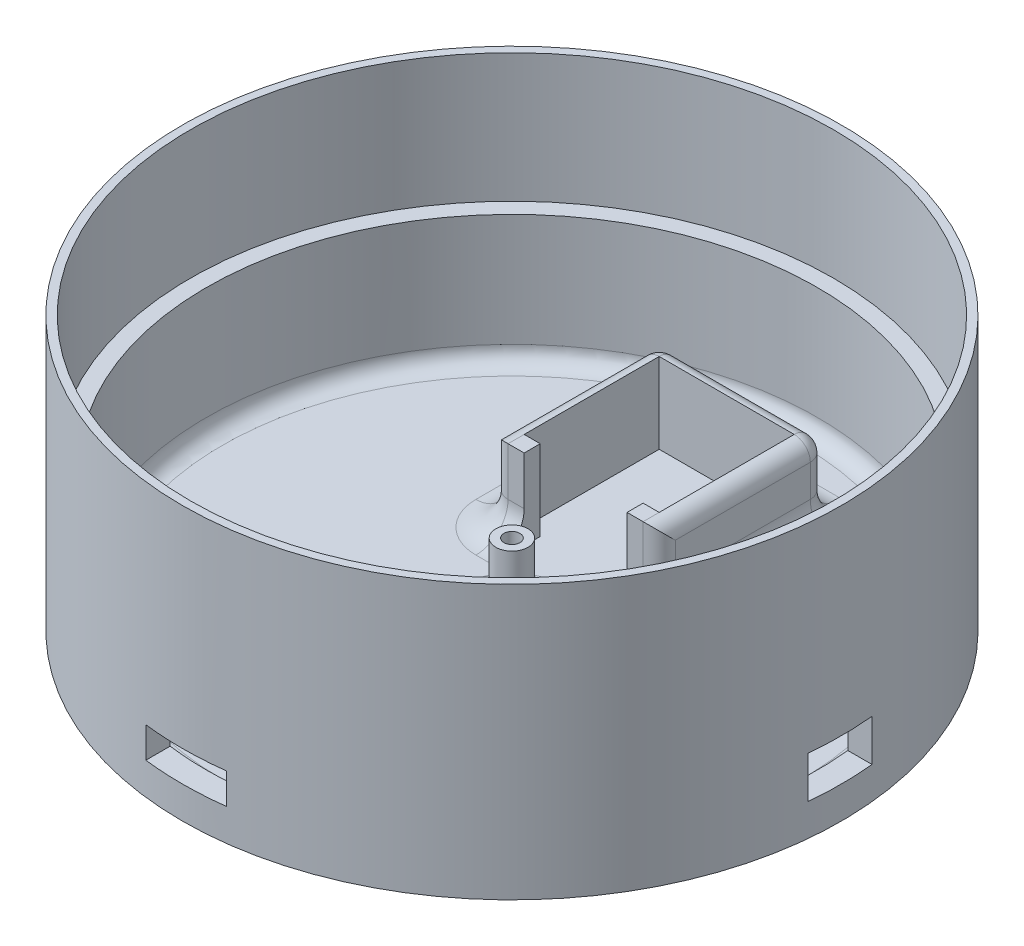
ISO-10303-21;
HEADER;
FILE_DESCRIPTION(('STEP AP214'),'2;1');
FILE_NAME('part.step','',(''),(''),'','','');
FILE_SCHEMA(('AUTOMOTIVE_DESIGN { 1 0 10303 214 1 1 1 1 }'));
ENDSEC;
DATA;
#1=APPLICATION_CONTEXT('core data for automotive mechanical design processes');
#2=APPLICATION_PROTOCOL_DEFINITION('international standard','automotive_design',2000,#1);
#3=PRODUCT_CONTEXT('',#1,'mechanical');
#4=PRODUCT('Part','Part','',(#3));
#5=PRODUCT_RELATED_PRODUCT_CATEGORY('part','',(#4));
#6=PRODUCT_DEFINITION_FORMATION('','',#4);
#7=PRODUCT_DEFINITION_CONTEXT('part definition',#1,'design');
#8=PRODUCT_DEFINITION('design','',#6,#7);
#9=PRODUCT_DEFINITION_SHAPE('','',#8);
#10=(LENGTH_UNIT() NAMED_UNIT(*) SI_UNIT(.MILLI.,.METRE.));
#11=(NAMED_UNIT(*) PLANE_ANGLE_UNIT() SI_UNIT($,.RADIAN.));
#12=(NAMED_UNIT(*) SI_UNIT($,.STERADIAN.) SOLID_ANGLE_UNIT());
#13=UNCERTAINTY_MEASURE_WITH_UNIT(LENGTH_MEASURE(1.E-05),#10,'distance_accuracy_value','');
#14=(GEOMETRIC_REPRESENTATION_CONTEXT(3) GLOBAL_UNCERTAINTY_ASSIGNED_CONTEXT((#13)) GLOBAL_UNIT_ASSIGNED_CONTEXT((#10,
#11,#12)) REPRESENTATION_CONTEXT('',''));
#15=CARTESIAN_POINT('',(0.,0.,0.));
#16=DIRECTION('',(0.,0.,1.));
#17=DIRECTION('',(1.,0.,0.));
#18=AXIS2_PLACEMENT_3D('',#15,#16,#17);
#19=CARTESIAN_POINT('',(-21.,15.,-24.8));
#20=DIRECTION('',(0.,1.,0.));
#21=DIRECTION('',(0.,0.,1.));
#22=AXIS2_PLACEMENT_3D('',#19,#20,#21);
#23=TOROIDAL_SURFACE('',#22,15.,10.);
#24=CARTESIAN_POINT('',(-21.,15.,-9.79999999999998));
#25=DIRECTION('',(-1.,0.,0.));
#26=DIRECTION('',(0.,0.,1.));
#27=AXIS2_PLACEMENT_3D('',#24,#25,#26);
#28=CIRCLE('',#27,10.);
#29=CARTESIAN_POINT('',(-21.,15.,-19.8));
#30=VERTEX_POINT('',#29);
#31=CARTESIAN_POINT('',(-21.,5.,-9.79999999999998));
#32=VERTEX_POINT('',#31);
#33=EDGE_CURVE('E58',#30,#32,#28,.T.);
#34=ORIENTED_EDGE('',*,*,#33,.F.);
#35=CARTESIAN_POINT('',(-21.,15.,-24.8));
#36=DIRECTION('',(0.,1.,0.));
#37=DIRECTION('',(0.,0.,1.));
#38=AXIS2_PLACEMENT_3D('',#35,#36,#37);
#39=CIRCLE('',#38,5.);
#40=CARTESIAN_POINT('',(-26.,15.,-24.8));
#41=VERTEX_POINT('',#40);
#42=EDGE_CURVE('E1085',#41,#30,#39,.T.);
#43=ORIENTED_EDGE('',*,*,#42,.F.);
#44=CARTESIAN_POINT('',(-36.,15.,-24.8));
#45=DIRECTION('',(0.,0.,-1.));
#46=DIRECTION('',(-1.,0.,0.));
#47=AXIS2_PLACEMENT_3D('',#44,#45,#46);
#48=CIRCLE('',#47,10.);
#49=CARTESIAN_POINT('',(-36.,5.,-24.8));
#50=VERTEX_POINT('',#49);
#51=EDGE_CURVE('E1114',#41,#50,#48,.T.);
#52=ORIENTED_EDGE('',*,*,#51,.T.);
#53=CARTESIAN_POINT('',(-21.,5.,-24.8));
#54=DIRECTION('',(0.,1.,0.));
#55=DIRECTION('',(0.,0.,1.));
#56=AXIS2_PLACEMENT_3D('',#53,#54,#55);
#57=CIRCLE('',#56,15.);
#58=EDGE_CURVE('E1029',#32,#50,#57,.F.);
#59=ORIENTED_EDGE('',*,*,#58,.F.);
#60=EDGE_LOOP('',(#34,#43,#52,#59));
#61=FACE_BOUND('',#60,.T.);
#62=ADVANCED_FACE('F48',(#61),#23,.F.);
#63=CARTESIAN_POINT('',(-36.,15.,-71.8));
#64=DIRECTION('',(0.,0.,1.));
#65=DIRECTION('',(1.,0.,0.));
#66=AXIS2_PLACEMENT_3D('',#63,#64,#65);
#67=CYLINDRICAL_SURFACE('',#66,10.);
#68=ORIENTED_EDGE('',*,*,#51,.F.);
#69=DIRECTION('',(0.,0.,1.));
#70=VECTOR('',#69,1.);
#71=CARTESIAN_POINT('',(-26.,15.,-71.8));
#72=LINE('',#71,#70);
#73=CARTESIAN_POINT('',(-26.,15.,-66.8));
#74=VERTEX_POINT('',#73);
#75=EDGE_CURVE('E1081',#74,#41,#72,.T.);
#76=ORIENTED_EDGE('',*,*,#75,.F.);
#77=CARTESIAN_POINT('',(-36.,15.,-66.8));
#78=DIRECTION('',(0.,0.,-1.));
#79=DIRECTION('',(-1.,0.,0.));
#80=AXIS2_PLACEMENT_3D('',#77,#78,#79);
#81=CIRCLE('',#80,10.);
#82=CARTESIAN_POINT('',(-36.,5.,-66.8));
#83=VERTEX_POINT('',#82);
#84=EDGE_CURVE('E1111',#74,#83,#81,.T.);
#85=ORIENTED_EDGE('',*,*,#84,.T.);
#86=DIRECTION('',(0.,0.,1.));
#87=VECTOR('',#86,1.);
#88=CARTESIAN_POINT('',(-36.,5.,0.));
#89=LINE('',#88,#87);
#90=EDGE_CURVE('E1033',#50,#83,#89,.F.);
#91=ORIENTED_EDGE('',*,*,#90,.F.);
#92=EDGE_LOOP('',(#68,#76,#85,#91));
#93=FACE_BOUND('',#92,.T.);
#94=ADVANCED_FACE('F1193',(#93),#67,.F.);
#95=CARTESIAN_POINT('',(-21.,15.,-66.8));
#96=DIRECTION('',(0.,1.,0.));
#97=DIRECTION('',(0.,0.,1.));
#98=AXIS2_PLACEMENT_3D('',#95,#96,#97);
#99=TOROIDAL_SURFACE('',#98,15.,10.);
#100=ORIENTED_EDGE('',*,*,#84,.F.);
#101=CARTESIAN_POINT('',(-21.,15.,-66.8));
#102=DIRECTION('',(0.,1.,0.));
#103=DIRECTION('',(0.,0.,1.));
#104=AXIS2_PLACEMENT_3D('',#101,#102,#103);
#105=CIRCLE('',#104,5.);
#106=CARTESIAN_POINT('',(-21.,15.,-71.8));
#107=VERTEX_POINT('',#106);
#108=EDGE_CURVE('E1077',#107,#74,#105,.T.);
#109=ORIENTED_EDGE('',*,*,#108,.F.);
#110=CARTESIAN_POINT('',(-21.,15.,-81.8));
#111=DIRECTION('',(1.,0.,0.));
#112=DIRECTION('',(0.,0.,-1.));
#113=AXIS2_PLACEMENT_3D('',#110,#111,#112);
#114=CIRCLE('',#113,10.);
#115=CARTESIAN_POINT('',(-21.,5.,-81.8));
#116=VERTEX_POINT('',#115);
#117=EDGE_CURVE('E1108',#107,#116,#114,.T.);
#118=ORIENTED_EDGE('',*,*,#117,.T.);
#119=CARTESIAN_POINT('',(-21.,5.,-66.8));
#120=DIRECTION('',(0.,1.,0.));
#121=DIRECTION('',(0.,0.,1.));
#122=AXIS2_PLACEMENT_3D('',#119,#120,#121);
#123=CIRCLE('',#122,15.);
#124=EDGE_CURVE('E1037',#83,#116,#123,.F.);
#125=ORIENTED_EDGE('',*,*,#124,.F.);
#126=EDGE_LOOP('',(#100,#109,#118,#125));
#127=FACE_BOUND('',#126,.T.);
#128=ADVANCED_FACE('F1150',(#127),#99,.F.);
#129=CARTESIAN_POINT('',(-26.,15.,-81.8));
#130=DIRECTION('',(-1.,0.,0.));
#131=DIRECTION('',(0.,0.,1.));
#132=AXIS2_PLACEMENT_3D('',#129,#130,#131);
#133=CYLINDRICAL_SURFACE('',#132,10.);
#134=ORIENTED_EDGE('',*,*,#117,.F.);
#135=DIRECTION('',(-1.,0.,0.));
#136=VECTOR('',#135,1.);
#137=CARTESIAN_POINT('',(-26.,15.,-71.8));
#138=LINE('',#137,#136);
#139=CARTESIAN_POINT('',(21.,15.,-71.8));
#140=VERTEX_POINT('',#139);
#141=EDGE_CURVE('E1073',#140,#107,#138,.T.);
#142=ORIENTED_EDGE('',*,*,#141,.F.);
#143=CARTESIAN_POINT('',(21.,15.,-81.8));
#144=DIRECTION('',(1.,0.,0.));
#145=DIRECTION('',(0.,0.,-1.));
#146=AXIS2_PLACEMENT_3D('',#143,#144,#145);
#147=CIRCLE('',#146,10.);
#148=CARTESIAN_POINT('',(21.,5.,-81.8));
#149=VERTEX_POINT('',#148);
#150=EDGE_CURVE('E1105',#140,#149,#147,.T.);
#151=ORIENTED_EDGE('',*,*,#150,.T.);
#152=DIRECTION('',(-1.,0.,0.));
#153=VECTOR('',#152,1.);
#154=CARTESIAN_POINT('',(0.,5.,-81.8));
#155=LINE('',#154,#153);
#156=EDGE_CURVE('E1041',#116,#149,#155,.F.);
#157=ORIENTED_EDGE('',*,*,#156,.F.);
#158=EDGE_LOOP('',(#134,#142,#151,#157));
#159=FACE_BOUND('',#158,.T.);
#160=ADVANCED_FACE('F1159',(#159),#133,.F.);
#161=CARTESIAN_POINT('',(21.,15.,-66.8));
#162=DIRECTION('',(0.,1.,0.));
#163=DIRECTION('',(0.,0.,1.));
#164=AXIS2_PLACEMENT_3D('',#161,#162,#163);
#165=TOROIDAL_SURFACE('',#164,15.,10.);
#166=ORIENTED_EDGE('',*,*,#150,.F.);
#167=CARTESIAN_POINT('',(21.,15.,-66.8));
#168=DIRECTION('',(0.,1.,0.));
#169=DIRECTION('',(0.,0.,1.));
#170=AXIS2_PLACEMENT_3D('',#167,#168,#169);
#171=CIRCLE('',#170,5.);
#172=CARTESIAN_POINT('',(26.,15.,-66.8));
#173=VERTEX_POINT('',#172);
#174=EDGE_CURVE('E1069',#173,#140,#171,.T.);
#175=ORIENTED_EDGE('',*,*,#174,.F.);
#176=CARTESIAN_POINT('',(36.,15.,-66.8));
#177=DIRECTION('',(0.,0.,1.));
#178=DIRECTION('',(1.,0.,0.));
#179=AXIS2_PLACEMENT_3D('',#176,#177,#178);
#180=CIRCLE('',#179,10.);
#181=CARTESIAN_POINT('',(36.,5.,-66.8));
#182=VERTEX_POINT('',#181);
#183=EDGE_CURVE('E1102',#173,#182,#180,.T.);
#184=ORIENTED_EDGE('',*,*,#183,.T.);
#185=CARTESIAN_POINT('',(21.,5.,-66.8));
#186=DIRECTION('',(0.,1.,0.));
#187=DIRECTION('',(0.,0.,1.));
#188=AXIS2_PLACEMENT_3D('',#185,#186,#187);
#189=CIRCLE('',#188,15.);
#190=EDGE_CURVE('E1045',#149,#182,#189,.F.);
#191=ORIENTED_EDGE('',*,*,#190,.F.);
#192=EDGE_LOOP('',(#166,#175,#184,#191));
#193=FACE_BOUND('',#192,.T.);
#194=ADVANCED_FACE('F1166',(#193),#165,.F.);
#195=CARTESIAN_POINT('',(36.,15.,-71.8));
#196=DIRECTION('',(0.,0.,-1.));
#197=DIRECTION('',(-1.,0.,0.));
#198=AXIS2_PLACEMENT_3D('',#195,#196,#197);
#199=CYLINDRICAL_SURFACE('',#198,10.);
#200=ORIENTED_EDGE('',*,*,#183,.F.);
#201=DIRECTION('',(0.,0.,-1.));
#202=VECTOR('',#201,1.);
#203=CARTESIAN_POINT('',(26.,15.,-71.8));
#204=LINE('',#203,#202);
#205=CARTESIAN_POINT('',(26.,15.,-24.8));
#206=VERTEX_POINT('',#205);
#207=EDGE_CURVE('E1065',#206,#173,#204,.T.);
#208=ORIENTED_EDGE('',*,*,#207,.F.);
#209=CARTESIAN_POINT('',(36.,15.,-24.8));
#210=DIRECTION('',(0.,0.,1.));
#211=DIRECTION('',(1.,0.,0.));
#212=AXIS2_PLACEMENT_3D('',#209,#210,#211);
#213=CIRCLE('',#212,10.);
#214=CARTESIAN_POINT('',(36.,5.,-24.8));
#215=VERTEX_POINT('',#214);
#216=EDGE_CURVE('E1099',#206,#215,#213,.T.);
#217=ORIENTED_EDGE('',*,*,#216,.T.);
#218=DIRECTION('',(0.,0.,-1.));
#219=VECTOR('',#218,1.);
#220=CARTESIAN_POINT('',(36.,5.,0.));
#221=LINE('',#220,#219);
#222=EDGE_CURVE('E1049',#182,#215,#221,.F.);
#223=ORIENTED_EDGE('',*,*,#222,.F.);
#224=EDGE_LOOP('',(#200,#208,#217,#223));
#225=FACE_BOUND('',#224,.T.);
#226=ADVANCED_FACE('F1174',(#225),#199,.F.);
#227=CARTESIAN_POINT('',(21.,15.,-24.8));
#228=DIRECTION('',(0.,1.,0.));
#229=DIRECTION('',(0.,0.,1.));
#230=AXIS2_PLACEMENT_3D('',#227,#228,#229);
#231=TOROIDAL_SURFACE('',#230,15.,10.);
#232=ORIENTED_EDGE('',*,*,#216,.F.);
#233=CARTESIAN_POINT('',(21.,15.,-24.8));
#234=DIRECTION('',(0.,1.,0.));
#235=DIRECTION('',(0.,0.,1.));
#236=AXIS2_PLACEMENT_3D('',#233,#234,#235);
#237=CIRCLE('',#236,5.);
#238=CARTESIAN_POINT('',(21.,15.,-19.8));
#239=VERTEX_POINT('',#238);
#240=EDGE_CURVE('E1061',#239,#206,#237,.T.);
#241=ORIENTED_EDGE('',*,*,#240,.F.);
#242=CARTESIAN_POINT('',(21.,15.,-9.79999999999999));
#243=DIRECTION('',(-1.,0.,0.));
#244=DIRECTION('',(0.,0.,1.));
#245=AXIS2_PLACEMENT_3D('',#242,#243,#244);
#246=CIRCLE('',#245,10.);
#247=CARTESIAN_POINT('',(21.,5.,-9.79999999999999));
#248=VERTEX_POINT('',#247);
#249=EDGE_CURVE('E1096',#239,#248,#246,.T.);
#250=ORIENTED_EDGE('',*,*,#249,.T.);
#251=CARTESIAN_POINT('',(21.,5.,-24.8));
#252=DIRECTION('',(0.,1.,0.));
#253=DIRECTION('',(0.,0.,1.));
#254=AXIS2_PLACEMENT_3D('',#251,#252,#253);
#255=CIRCLE('',#254,15.);
#256=EDGE_CURVE('E1053',#215,#248,#255,.F.);
#257=ORIENTED_EDGE('',*,*,#256,.F.);
#258=EDGE_LOOP('',(#232,#241,#250,#257));
#259=FACE_BOUND('',#258,.T.);
#260=ADVANCED_FACE('F1182',(#259),#231,.F.);
#261=CARTESIAN_POINT('',(26.,15.,-9.79999999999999));
#262=DIRECTION('',(1.,0.,0.));
#263=DIRECTION('',(0.,0.,-1.));
#264=AXIS2_PLACEMENT_3D('',#261,#262,#263);
#265=CYLINDRICAL_SURFACE('',#264,10.);
#266=ORIENTED_EDGE('',*,*,#249,.F.);
#267=DIRECTION('',(1.,0.,0.));
#268=VECTOR('',#267,1.);
#269=CARTESIAN_POINT('',(26.,15.,-19.8));
#270=LINE('',#269,#268);
#271=CARTESIAN_POINT('',(16.,15.,-19.8));
#272=VERTEX_POINT('',#271);
#273=EDGE_CURVE('E1021',#272,#239,#270,.T.);
#274=ORIENTED_EDGE('',*,*,#273,.F.);
#275=CARTESIAN_POINT('',(16.,15.,-9.79999999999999));
#276=DIRECTION('',(1.,0.,0.));
#277=DIRECTION('',(0.,0.,-1.));
#278=AXIS2_PLACEMENT_3D('',#275,#276,#277);
#279=CIRCLE('',#278,10.);
#280=CARTESIAN_POINT('',(16.,5.,-9.79999999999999));
#281=VERTEX_POINT('',#280);
#282=EDGE_CURVE('E1092',#272,#281,#279,.F.);
#283=ORIENTED_EDGE('',*,*,#282,.T.);
#284=DIRECTION('',(1.,0.,0.));
#285=VECTOR('',#284,1.);
#286=CARTESIAN_POINT('',(0.,5.,-9.79999999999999));
#287=LINE('',#286,#285);
#288=EDGE_CURVE('E1057',#248,#281,#287,.F.);
#289=ORIENTED_EDGE('',*,*,#288,.F.);
#290=EDGE_LOOP('',(#266,#274,#283,#289));
#291=FACE_BOUND('',#290,.T.);
#292=ADVANCED_FACE('F1190',(#291),#265,.F.);
#293=CARTESIAN_POINT('',(-26.,15.,-9.79999999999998));
#294=DIRECTION('',(1.,0.,0.));
#295=DIRECTION('',(0.,0.,-1.));
#296=AXIS2_PLACEMENT_3D('',#293,#294,#295);
#297=CYLINDRICAL_SURFACE('',#296,10.);
#298=DIRECTION('',(1.,0.,0.));
#299=VECTOR('',#298,1.);
#300=CARTESIAN_POINT('',(-26.,15.,-19.8));
#301=LINE('',#300,#299);
#302=CARTESIAN_POINT('',(-16.,15.,-19.8));
#303=VERTEX_POINT('',#302);
#304=EDGE_CURVE('E1089',#30,#303,#301,.T.);
#305=ORIENTED_EDGE('',*,*,#304,.F.);
#306=ORIENTED_EDGE('',*,*,#33,.T.);
#307=DIRECTION('',(1.,0.,0.));
#308=VECTOR('',#307,1.);
#309=CARTESIAN_POINT('',(0.,5.,-9.79999999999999));
#310=LINE('',#309,#308);
#311=CARTESIAN_POINT('',(-16.,5.,-9.79999999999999));
#312=VERTEX_POINT('',#311);
#313=EDGE_CURVE('E1025',#312,#32,#310,.F.);
#314=ORIENTED_EDGE('',*,*,#313,.F.);
#315=CARTESIAN_POINT('',(-16.,15.,-9.79999999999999));
#316=DIRECTION('',(-1.,0.,0.));
#317=DIRECTION('',(0.,0.,1.));
#318=AXIS2_PLACEMENT_3D('',#315,#316,#317);
#319=CIRCLE('',#318,10.);
#320=EDGE_CURVE('E11',#312,#303,#319,.F.);
#321=ORIENTED_EDGE('',*,*,#320,.T.);
#322=EDGE_LOOP('',(#305,#306,#314,#321));
#323=FACE_BOUND('',#322,.T.);
#324=ADVANCED_FACE('F50',(#323),#297,.F.);
#325=CARTESIAN_POINT('',(0.,15.,0.));
#326=DIRECTION('',(0.,1.,0.));
#327=DIRECTION('',(0.,0.,1.));
#328=AXIS2_PLACEMENT_3D('',#325,#326,#327);
#329=TOROIDAL_SURFACE('',#328,15.,10.);
#330=CARTESIAN_POINT('',(0.,15.,0.));
#331=DIRECTION('',(0.,1.,0.));
#332=DIRECTION('',(0.,0.,1.));
#333=AXIS2_PLACEMENT_3D('',#330,#331,#332);
#334=CIRCLE('',#333,5.);
#335=CARTESIAN_POINT('',(0.,15.,5.));
#336=VERTEX_POINT('',#335);
#337=EDGE_CURVE('E1013',#336,#336,#334,.T.);
#338=ORIENTED_EDGE('',*,*,#337,.F.);
#339=EDGE_LOOP('',(#338));
#340=FACE_BOUND('',#339,.T.);
#341=CARTESIAN_POINT('',(0.,5.,0.));
#342=DIRECTION('',(0.,1.,0.));
#343=DIRECTION('',(0.,0.,1.));
#344=AXIS2_PLACEMENT_3D('',#341,#342,#343);
#345=CIRCLE('',#344,15.);
#346=CARTESIAN_POINT('',(0.,5.,15.));
#347=VERTEX_POINT('',#346);
#348=EDGE_CURVE('E1017',#347,#347,#345,.F.);
#349=ORIENTED_EDGE('',*,*,#348,.F.);
#350=EDGE_LOOP('',(#349));
#351=FACE_BOUND('',#350,.T.);
#352=ADVANCED_FACE('F722',(#340,#351),#329,.F.);
#353=CARTESIAN_POINT('',(0.,30.,0.));
#354=DIRECTION('',(0.,-1.,0.));
#355=DIRECTION('',(0.,0.,-1.));
#356=AXIS2_PLACEMENT_3D('',#353,#354,#355);
#357=PLANE('',#356);
#358=DIRECTION('',(-1.,0.,0.));
#359=VECTOR('',#358,1.);
#360=CARTESIAN_POINT('',(-21.,30.,-24.8));
#361=LINE('',#360,#359);
#362=CARTESIAN_POINT('',(-16.,30.,-24.8));
#363=VERTEX_POINT('',#362);
#364=CARTESIAN_POINT('',(-21.,30.,-24.8));
#365=VERTEX_POINT('',#364);
#366=EDGE_CURVE('E495',#363,#365,#361,.T.);
#367=ORIENTED_EDGE('',*,*,#366,.T.);
#368=DIRECTION('',(0.,0.,1.));
#369=VECTOR('',#368,1.);
#370=CARTESIAN_POINT('',(-21.,30.,0.));
#371=LINE('',#370,#369);
#372=CARTESIAN_POINT('',(-21.,30.,-19.8));
#373=VERTEX_POINT('',#372);
#374=EDGE_CURVE('E649',#365,#373,#371,.T.);
#375=ORIENTED_EDGE('',*,*,#374,.T.);
#376=DIRECTION('',(1.,0.,0.));
#377=VECTOR('',#376,1.);
#378=CARTESIAN_POINT('',(-26.,30.,-19.8));
#379=LINE('',#378,#377);
#380=CARTESIAN_POINT('',(-16.,30.,-19.8));
#381=VERTEX_POINT('',#380);
#382=EDGE_CURVE('E489',#373,#381,#379,.T.);
#383=ORIENTED_EDGE('',*,*,#382,.T.);
#384=DIRECTION('',(0.,0.,-1.));
#385=VECTOR('',#384,1.);
#386=CARTESIAN_POINT('',(-16.,30.,-24.8));
#387=LINE('',#386,#385);
#388=EDGE_CURVE('E492',#381,#363,#387,.T.);
#389=ORIENTED_EDGE('',*,*,#388,.T.);
#390=EDGE_LOOP('',(#367,#375,#383,#389));
#391=FACE_BOUND('',#390,.T.);
#392=ADVANCED_FACE('F1216',(#391),#357,.F.);
#393=CARTESIAN_POINT('',(0.,5.,0.));
#394=DIRECTION('',(0.,-1.,0.));
#395=DIRECTION('',(0.,0.,-1.));
#396=AXIS2_PLACEMENT_3D('',#393,#394,#395);
#397=CYLINDRICAL_SURFACE('',#396,102.5);
#398=DIRECTION('',(0.,-1.,0.));
#399=VECTOR('',#398,1.);
#400=CARTESIAN_POINT('',(-12.0742068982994,5.,101.786362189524));
#401=LINE('',#400,#399);
#402=CARTESIAN_POINT('',(-12.0742068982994,19.568239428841,101.786362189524));
#403=VERTEX_POINT('',#402);
#404=CARTESIAN_POINT('',(-12.0742068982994,10.,101.786362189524));
#405=VERTEX_POINT('',#404);
#406=EDGE_CURVE('E473',#403,#405,#401,.T.);
#407=ORIENTED_EDGE('',*,*,#406,.F.);
#408=CARTESIAN_POINT('',(0.,19.568239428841,0.));
#409=DIRECTION('',(0.,-1.,0.));
#410=DIRECTION('',(1.,0.,0.));
#411=AXIS2_PLACEMENT_3D('',#408,#409,#410);
#412=CIRCLE('',#411,102.5);
#413=CARTESIAN_POINT('',(12.9257931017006,19.5682394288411,101.681728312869));
#414=VERTEX_POINT('',#413);
#415=EDGE_CURVE('E463',#414,#403,#412,.T.);
#416=ORIENTED_EDGE('',*,*,#415,.F.);
#417=DIRECTION('',(0.,-1.,0.));
#418=VECTOR('',#417,1.);
#419=CARTESIAN_POINT('',(12.9257931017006,5.,101.681728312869));
#420=LINE('',#419,#418);
#421=CARTESIAN_POINT('',(12.9257931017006,10.,101.681728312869));
#422=VERTEX_POINT('',#421);
#423=EDGE_CURVE('E466',#422,#414,#420,.F.);
#424=ORIENTED_EDGE('',*,*,#423,.F.);
#425=CARTESIAN_POINT('',(0.,10.,0.));
#426=DIRECTION('',(0.,1.,0.));
#427=DIRECTION('',(0.,0.,1.));
#428=AXIS2_PLACEMENT_3D('',#425,#426,#427);
#429=CIRCLE('',#428,102.5);
#430=EDGE_CURVE('E470',#405,#422,#429,.T.);
#431=ORIENTED_EDGE('',*,*,#430,.F.);
#432=EDGE_LOOP('',(#407,#416,#424,#431));
#433=FACE_BOUND('',#432,.T.);
#434=CARTESIAN_POINT('',(0.,0.,0.));
#435=DIRECTION('',(0.,1.,0.));
#436=DIRECTION('',(0.,0.,1.));
#437=AXIS2_PLACEMENT_3D('',#434,#435,#436);
#438=CIRCLE('',#437,102.5);
#439=CARTESIAN_POINT('',(0.,0.,102.5));
#440=VERTEX_POINT('',#439);
#441=EDGE_CURVE('E573',#440,#440,#438,.T.);
#442=ORIENTED_EDGE('',*,*,#441,.T.);
#443=EDGE_LOOP('',(#442));
#444=FACE_BOUND('',#443,.T.);
#445=CARTESIAN_POINT('',(0.,85.,0.));
#446=DIRECTION('',(0.,1.,0.));
#447=DIRECTION('',(0.,0.,1.));
#448=AXIS2_PLACEMENT_3D('',#445,#446,#447);
#449=CIRCLE('',#448,102.5);
#450=CARTESIAN_POINT('',(0.,85.,102.5));
#451=VERTEX_POINT('',#450);
#452=EDGE_CURVE('E569',#451,#451,#449,.T.);
#453=ORIENTED_EDGE('',*,*,#452,.F.);
#454=EDGE_LOOP('',(#453));
#455=FACE_BOUND('',#454,.T.);
#456=DIRECTION('',(0.,-1.,0.));
#457=VECTOR('',#456,1.);
#458=CARTESIAN_POINT('',(102.011028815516,5.,10.));
#459=LINE('',#458,#457);
#460=CARTESIAN_POINT('',(102.011028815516,23.,10.));
#461=VERTEX_POINT('',#460);
#462=CARTESIAN_POINT('',(102.011028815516,10.,10.));
#463=VERTEX_POINT('',#462);
#464=EDGE_CURVE('E431',#461,#463,#459,.T.);
#465=ORIENTED_EDGE('',*,*,#464,.F.);
#466=CARTESIAN_POINT('',(0.,23.,0.));
#467=DIRECTION('',(0.,-1.,0.));
#468=DIRECTION('',(0.,0.,-1.));
#469=AXIS2_PLACEMENT_3D('',#466,#467,#468);
#470=CIRCLE('',#469,102.5);
#471=CARTESIAN_POINT('',(102.011028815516,23.,-10.));
#472=VERTEX_POINT('',#471);
#473=EDGE_CURVE('E413',#472,#461,#470,.T.);
#474=ORIENTED_EDGE('',*,*,#473,.F.);
#475=DIRECTION('',(0.,-1.,0.));
#476=VECTOR('',#475,1.);
#477=CARTESIAN_POINT('',(102.011028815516,5.,-10.));
#478=LINE('',#477,#476);
#479=CARTESIAN_POINT('',(102.011028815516,10.,-10.));
#480=VERTEX_POINT('',#479);
#481=EDGE_CURVE('E425',#480,#472,#478,.F.);
#482=ORIENTED_EDGE('',*,*,#481,.F.);
#483=CARTESIAN_POINT('',(0.,10.,0.));
#484=DIRECTION('',(0.,1.,0.));
#485=DIRECTION('',(0.,0.,1.));
#486=AXIS2_PLACEMENT_3D('',#483,#484,#485);
#487=CIRCLE('',#486,102.5);
#488=EDGE_CURVE('E441',#463,#480,#487,.T.);
#489=ORIENTED_EDGE('',*,*,#488,.F.);
#490=EDGE_LOOP('',(#465,#474,#482,#489));
#491=FACE_BOUND('',#490,.T.);
#492=ADVANCED_FACE('F440',(#433,#444,#455,#491),#397,.T.);
#493=CARTESIAN_POINT('',(0.,45.,0.));
#494=DIRECTION('',(0.,-1.,0.));
#495=DIRECTION('',(0.,0.,-1.));
#496=AXIS2_PLACEMENT_3D('',#493,#494,#495);
#497=CYLINDRICAL_SURFACE('',#496,95.);
#498=CARTESIAN_POINT('',(0.,45.,0.));
#499=DIRECTION('',(0.,1.,0.));
#500=DIRECTION('',(0.,0.,1.));
#501=AXIS2_PLACEMENT_3D('',#498,#499,#500);
#502=CIRCLE('',#501,95.);
#503=CARTESIAN_POINT('',(0.,45.,95.));
#504=VERTEX_POINT('',#503);
#505=EDGE_CURVE('E561',#504,#504,#502,.T.);
#506=ORIENTED_EDGE('',*,*,#505,.T.);
#507=EDGE_LOOP('',(#506));
#508=FACE_BOUND('',#507,.T.);
#509=DIRECTION('',(0.,-1.,0.));
#510=VECTOR('',#509,1.);
#511=CARTESIAN_POINT('',(-12.0742068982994,45.,94.2295788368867));
#512=LINE('',#511,#510);
#513=CARTESIAN_POINT('',(-12.0742068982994,19.568239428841,94.2295788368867));
#514=VERTEX_POINT('',#513);
#515=CARTESIAN_POINT('',(-12.0742068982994,10.,94.2295788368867));
#516=VERTEX_POINT('',#515);
#517=EDGE_CURVE('E593',#514,#516,#512,.T.);
#518=ORIENTED_EDGE('',*,*,#517,.T.);
#519=CARTESIAN_POINT('',(0.,10.,0.));
#520=DIRECTION('',(0.,1.,0.));
#521=DIRECTION('',(0.,0.,1.));
#522=AXIS2_PLACEMENT_3D('',#519,#520,#521);
#523=CIRCLE('',#522,95.);
#524=CARTESIAN_POINT('',(94.4722181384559,10.,-10.));
#525=VERTEX_POINT('',#524);
#526=EDGE_CURVE('E655',#516,#525,#523,.F.);
#527=ORIENTED_EDGE('',*,*,#526,.T.);
#528=DIRECTION('',(0.,-1.,0.));
#529=VECTOR('',#528,1.);
#530=CARTESIAN_POINT('',(94.4722181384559,45.,-10.));
#531=LINE('',#530,#529);
#532=CARTESIAN_POINT('',(94.4722181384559,23.,-10.));
#533=VERTEX_POINT('',#532);
#534=EDGE_CURVE('E600',#525,#533,#531,.F.);
#535=ORIENTED_EDGE('',*,*,#534,.T.);
#536=CARTESIAN_POINT('',(0.,23.,0.));
#537=DIRECTION('',(0.,-1.,0.));
#538=DIRECTION('',(0.,0.,-1.));
#539=AXIS2_PLACEMENT_3D('',#536,#537,#538);
#540=CIRCLE('',#539,95.);
#541=CARTESIAN_POINT('',(94.4722181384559,23.,10.));
#542=VERTEX_POINT('',#541);
#543=EDGE_CURVE('E597',#533,#542,#540,.T.);
#544=ORIENTED_EDGE('',*,*,#543,.T.);
#545=DIRECTION('',(0.,-1.,0.));
#546=VECTOR('',#545,1.);
#547=CARTESIAN_POINT('',(94.4722181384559,45.,10.));
#548=LINE('',#547,#546);
#549=CARTESIAN_POINT('',(94.4722181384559,10.,10.));
#550=VERTEX_POINT('',#549);
#551=EDGE_CURVE('E434',#542,#550,#548,.T.);
#552=ORIENTED_EDGE('',*,*,#551,.T.);
#553=CARTESIAN_POINT('',(0.,10.,0.));
#554=DIRECTION('',(0.,1.,0.));
#555=DIRECTION('',(0.,0.,1.));
#556=AXIS2_PLACEMENT_3D('',#553,#554,#555);
#557=CIRCLE('',#556,95.);
#558=CARTESIAN_POINT('',(12.9257931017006,10.,94.1165440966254));
#559=VERTEX_POINT('',#558);
#560=EDGE_CURVE('E652',#550,#559,#557,.F.);
#561=ORIENTED_EDGE('',*,*,#560,.T.);
#562=DIRECTION('',(0.,-1.,0.));
#563=VECTOR('',#562,1.);
#564=CARTESIAN_POINT('',(12.9257931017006,45.,94.1165440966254));
#565=LINE('',#564,#563);
#566=CARTESIAN_POINT('',(12.9257931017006,19.5682394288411,94.1165440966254));
#567=VERTEX_POINT('',#566);
#568=EDGE_CURVE('E585',#559,#567,#565,.F.);
#569=ORIENTED_EDGE('',*,*,#568,.T.);
#570=CARTESIAN_POINT('',(0.,19.568239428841,0.));
#571=DIRECTION('',(0.,-1.,0.));
#572=DIRECTION('',(1.,0.,0.));
#573=AXIS2_PLACEMENT_3D('',#570,#571,#572);
#574=CIRCLE('',#573,95.);
#575=EDGE_CURVE('E581',#567,#514,#574,.T.);
#576=ORIENTED_EDGE('',*,*,#575,.T.);
#577=EDGE_LOOP('',(#518,#527,#535,#544,#552,#561,#569,#576));
#578=FACE_BOUND('',#577,.T.);
#579=ADVANCED_FACE('F1231',(#508,#578),#497,.F.);
#580=CARTESIAN_POINT('',(0.,5.,0.));
#581=DIRECTION('',(0.,1.,0.));
#582=DIRECTION('',(0.,0.,1.));
#583=AXIS2_PLACEMENT_3D('',#580,#581,#582);
#584=PLANE('',#583);
#585=ORIENTED_EDGE('',*,*,#348,.T.);
#586=EDGE_LOOP('',(#585));
#587=FACE_BOUND('',#586,.T.);
#588=CARTESIAN_POINT('',(0.,5.,0.));
#589=DIRECTION('',(0.,1.,0.));
#590=DIRECTION('',(0.,0.,1.));
#591=AXIS2_PLACEMENT_3D('',#588,#589,#590);
#592=CIRCLE('',#591,90.);
#593=CARTESIAN_POINT('',(0.,5.,90.));
#594=VERTEX_POINT('',#593);
#595=EDGE_CURVE('E659',#594,#594,#592,.T.);
#596=ORIENTED_EDGE('',*,*,#595,.T.);
#597=EDGE_LOOP('',(#596));
#598=FACE_BOUND('',#597,.T.);
#599=ORIENTED_EDGE('',*,*,#288,.T.);
#600=DIRECTION('',(0.,0.,1.));
#601=VECTOR('',#600,1.);
#602=CARTESIAN_POINT('',(16.,5.,-24.8));
#603=LINE('',#602,#601);
#604=CARTESIAN_POINT('',(16.,5.,-24.8));
#605=VERTEX_POINT('',#604);
#606=EDGE_CURVE('E514',#605,#281,#603,.T.);
#607=ORIENTED_EDGE('',*,*,#606,.F.);
#608=DIRECTION('',(-1.,0.,0.));
#609=VECTOR('',#608,1.);
#610=CARTESIAN_POINT('',(16.,5.,-24.8));
#611=LINE('',#610,#609);
#612=CARTESIAN_POINT('',(21.,5.,-24.8));
#613=VERTEX_POINT('',#612);
#614=EDGE_CURVE('E476',#613,#605,#611,.T.);
#615=ORIENTED_EDGE('',*,*,#614,.F.);
#616=DIRECTION('',(0.,0.,1.));
#617=VECTOR('',#616,1.);
#618=CARTESIAN_POINT('',(21.,5.,-66.8));
#619=LINE('',#618,#617);
#620=CARTESIAN_POINT('',(21.,5.,-66.8));
#621=VERTEX_POINT('',#620);
#622=EDGE_CURVE('E482',#621,#613,#619,.T.);
#623=ORIENTED_EDGE('',*,*,#622,.F.);
#624=DIRECTION('',(1.,0.,0.));
#625=VECTOR('',#624,1.);
#626=CARTESIAN_POINT('',(-21.,5.,-66.8));
#627=LINE('',#626,#625);
#628=CARTESIAN_POINT('',(-21.,5.,-66.8));
#629=VERTEX_POINT('',#628);
#630=EDGE_CURVE('E526',#629,#621,#627,.T.);
#631=ORIENTED_EDGE('',*,*,#630,.F.);
#632=DIRECTION('',(0.,0.,-1.));
#633=VECTOR('',#632,1.);
#634=CARTESIAN_POINT('',(-21.,5.,-66.8));
#635=LINE('',#634,#633);
#636=CARTESIAN_POINT('',(-21.,5.,-24.8));
#637=VERTEX_POINT('',#636);
#638=EDGE_CURVE('E523',#637,#629,#635,.T.);
#639=ORIENTED_EDGE('',*,*,#638,.F.);
#640=DIRECTION('',(-1.,0.,0.));
#641=VECTOR('',#640,1.);
#642=CARTESIAN_POINT('',(-21.,5.,-24.8));
#643=LINE('',#642,#641);
#644=CARTESIAN_POINT('',(-16.,5.,-24.8));
#645=VERTEX_POINT('',#644);
#646=EDGE_CURVE('E520',#645,#637,#643,.T.);
#647=ORIENTED_EDGE('',*,*,#646,.F.);
#648=DIRECTION('',(0.,0.,-1.));
#649=VECTOR('',#648,1.);
#650=CARTESIAN_POINT('',(-16.,5.,-24.8));
#651=LINE('',#650,#649);
#652=EDGE_CURVE('E517',#312,#645,#651,.T.);
#653=ORIENTED_EDGE('',*,*,#652,.F.);
#654=ORIENTED_EDGE('',*,*,#313,.T.);
#655=ORIENTED_EDGE('',*,*,#58,.T.);
#656=ORIENTED_EDGE('',*,*,#90,.T.);
#657=ORIENTED_EDGE('',*,*,#124,.T.);
#658=ORIENTED_EDGE('',*,*,#156,.T.);
#659=ORIENTED_EDGE('',*,*,#190,.T.);
#660=ORIENTED_EDGE('',*,*,#222,.T.);
#661=ORIENTED_EDGE('',*,*,#256,.T.);
#662=EDGE_LOOP('',(#599,#607,#615,#623,#631,#639,#647,#653,#654,#655,#656,#657,#658,#659,#660,#661));
#663=FACE_BOUND('',#662,.T.);
#664=ADVANCED_FACE('F1119',(#587,#598,#663),#584,.T.);
#665=CARTESIAN_POINT('',(0.,0.,0.));
#666=DIRECTION('',(0.,1.,0.));
#667=DIRECTION('',(0.,0.,1.));
#668=AXIS2_PLACEMENT_3D('',#665,#666,#667);
#669=PLANE('',#668);
#670=ORIENTED_EDGE('',*,*,#441,.F.);
#671=EDGE_LOOP('',(#670));
#672=FACE_BOUND('',#671,.T.);
#673=ADVANCED_FACE('F1230',(#672),#669,.F.);
#674=CARTESIAN_POINT('',(0.,85.,0.));
#675=DIRECTION('',(0.,-1.,0.));
#676=DIRECTION('',(0.,0.,-1.));
#677=AXIS2_PLACEMENT_3D('',#674,#675,#676);
#678=CYLINDRICAL_SURFACE('',#677,100.);
#679=CARTESIAN_POINT('',(0.,45.,0.));
#680=DIRECTION('',(0.,1.,0.));
#681=DIRECTION('',(0.,0.,1.));
#682=AXIS2_PLACEMENT_3D('',#679,#680,#681);
#683=CIRCLE('',#682,100.);
#684=CARTESIAN_POINT('',(0.,45.,100.));
#685=VERTEX_POINT('',#684);
#686=EDGE_CURVE('E577',#685,#685,#683,.T.);
#687=ORIENTED_EDGE('',*,*,#686,.F.);
#688=EDGE_LOOP('',(#687));
#689=FACE_BOUND('',#688,.T.);
#690=CARTESIAN_POINT('',(0.,85.,0.));
#691=DIRECTION('',(0.,1.,0.));
#692=DIRECTION('',(0.,0.,1.));
#693=AXIS2_PLACEMENT_3D('',#690,#691,#692);
#694=CIRCLE('',#693,100.);
#695=CARTESIAN_POINT('',(0.,85.,100.));
#696=VERTEX_POINT('',#695);
#697=EDGE_CURVE('E565',#696,#696,#694,.T.);
#698=ORIENTED_EDGE('',*,*,#697,.T.);
#699=EDGE_LOOP('',(#698));
#700=FACE_BOUND('',#699,.T.);
#701=ADVANCED_FACE('F1354',(#689,#700),#678,.F.);
#702=CARTESIAN_POINT('',(0.,85.,0.));
#703=DIRECTION('',(0.,1.,0.));
#704=DIRECTION('',(0.,0.,1.));
#705=AXIS2_PLACEMENT_3D('',#702,#703,#704);
#706=PLANE('',#705);
#707=ORIENTED_EDGE('',*,*,#697,.F.);
#708=EDGE_LOOP('',(#707));
#709=FACE_BOUND('',#708,.T.);
#710=ORIENTED_EDGE('',*,*,#452,.T.);
#711=EDGE_LOOP('',(#710));
#712=FACE_BOUND('',#711,.T.);
#713=ADVANCED_FACE('F1350',(#709,#712),#706,.T.);
#714=CARTESIAN_POINT('',(0.,45.,0.));
#715=DIRECTION('',(0.,1.,0.));
#716=DIRECTION('',(0.,0.,1.));
#717=AXIS2_PLACEMENT_3D('',#714,#715,#716);
#718=PLANE('',#717);
#719=ORIENTED_EDGE('',*,*,#686,.T.);
#720=EDGE_LOOP('',(#719));
#721=FACE_BOUND('',#720,.T.);
#722=ORIENTED_EDGE('',*,*,#505,.F.);
#723=EDGE_LOOP('',(#722));
#724=FACE_BOUND('',#723,.T.);
#725=ADVANCED_FACE('F1343',(#721,#724),#718,.T.);
#726=CARTESIAN_POINT('',(16.,30.,-24.8));
#727=DIRECTION('',(0.,0.,1.));
#728=DIRECTION('',(1.,0.,0.));
#729=AXIS2_PLACEMENT_3D('',#726,#727,#728);
#730=PLANE('',#729);
#731=ORIENTED_EDGE('',*,*,#614,.T.);
#732=DIRECTION('',(0.,-1.,0.));
#733=VECTOR('',#732,1.);
#734=CARTESIAN_POINT('',(16.,30.,-24.8));
#735=LINE('',#734,#733);
#736=CARTESIAN_POINT('',(16.,30.,-24.8));
#737=VERTEX_POINT('',#736);
#738=EDGE_CURVE('E558',#737,#605,#735,.T.);
#739=ORIENTED_EDGE('',*,*,#738,.F.);
#740=DIRECTION('',(-1.,0.,0.));
#741=VECTOR('',#740,1.);
#742=CARTESIAN_POINT('',(16.,30.,-24.8));
#743=LINE('',#742,#741);
#744=CARTESIAN_POINT('',(21.,30.,-24.8));
#745=VERTEX_POINT('',#744);
#746=EDGE_CURVE('E477',#745,#737,#743,.T.);
#747=ORIENTED_EDGE('',*,*,#746,.F.);
#748=DIRECTION('',(0.,-1.,0.));
#749=VECTOR('',#748,1.);
#750=CARTESIAN_POINT('',(21.,30.,-24.8));
#751=LINE('',#750,#749);
#752=EDGE_CURVE('E510',#745,#613,#751,.T.);
#753=ORIENTED_EDGE('',*,*,#752,.T.);
#754=EDGE_LOOP('',(#731,#739,#747,#753));
#755=FACE_BOUND('',#754,.T.);
#756=ADVANCED_FACE('F1339',(#755),#730,.F.);
#757=CARTESIAN_POINT('',(16.,30.,-24.8));
#758=DIRECTION('',(1.,0.,0.));
#759=DIRECTION('',(0.,0.,-1.));
#760=AXIS2_PLACEMENT_3D('',#757,#758,#759);
#761=PLANE('',#760);
#762=ORIENTED_EDGE('',*,*,#606,.T.);
#763=ORIENTED_EDGE('',*,*,#282,.F.);
#764=DIRECTION('',(0.,-1.,0.));
#765=VECTOR('',#764,1.);
#766=CARTESIAN_POINT('',(16.,30.,-19.8));
#767=LINE('',#766,#765);
#768=CARTESIAN_POINT('',(16.,30.,-19.8));
#769=VERTEX_POINT('',#768);
#770=EDGE_CURVE('E554',#769,#272,#767,.T.);
#771=ORIENTED_EDGE('',*,*,#770,.F.);
#772=DIRECTION('',(0.,0.,1.));
#773=VECTOR('',#772,1.);
#774=CARTESIAN_POINT('',(16.,30.,-24.8));
#775=LINE('',#774,#773);
#776=EDGE_CURVE('E481',#737,#769,#775,.T.);
#777=ORIENTED_EDGE('',*,*,#776,.F.);
#778=ORIENTED_EDGE('',*,*,#738,.T.);
#779=EDGE_LOOP('',(#762,#763,#771,#777,#778));
#780=FACE_BOUND('',#779,.T.);
#781=ADVANCED_FACE('F1336',(#780),#761,.F.);
#782=CARTESIAN_POINT('',(26.,30.,-19.8));
#783=DIRECTION('',(0.,0.,-1.));
#784=DIRECTION('',(-1.,0.,0.));
#785=AXIS2_PLACEMENT_3D('',#782,#783,#784);
#786=PLANE('',#785);
#787=ORIENTED_EDGE('',*,*,#770,.T.);
#788=ORIENTED_EDGE('',*,*,#273,.T.);
#789=DIRECTION('',(0.,-1.,0.));
#790=VECTOR('',#789,1.);
#791=CARTESIAN_POINT('',(21.,30.,-19.8));
#792=LINE('',#791,#790);
#793=CARTESIAN_POINT('',(21.,30.,-19.8));
#794=VERTEX_POINT('',#793);
#795=EDGE_CURVE('E643',#239,#794,#792,.F.);
#796=ORIENTED_EDGE('',*,*,#795,.T.);
#797=DIRECTION('',(1.,0.,0.));
#798=VECTOR('',#797,1.);
#799=CARTESIAN_POINT('',(26.,30.,-19.8));
#800=LINE('',#799,#798);
#801=EDGE_CURVE('E485',#769,#794,#800,.T.);
#802=ORIENTED_EDGE('',*,*,#801,.F.);
#803=EDGE_LOOP('',(#787,#788,#796,#802));
#804=FACE_BOUND('',#803,.T.);
#805=ADVANCED_FACE('F1186',(#804),#786,.F.);
#806=CARTESIAN_POINT('',(26.,30.,-71.8));
#807=DIRECTION('',(-1.,0.,0.));
#808=DIRECTION('',(0.,0.,1.));
#809=AXIS2_PLACEMENT_3D('',#806,#807,#808);
#810=PLANE('',#809);
#811=DIRECTION('',(0.,-1.,0.));
#812=VECTOR('',#811,1.);
#813=CARTESIAN_POINT('',(26.,30.,-24.8));
#814=LINE('',#813,#812);
#815=CARTESIAN_POINT('',(26.,25.,-24.8));
#816=VERTEX_POINT('',#815);
#817=EDGE_CURVE('E622',#816,#206,#814,.T.);
#818=ORIENTED_EDGE('',*,*,#817,.T.);
#819=ORIENTED_EDGE('',*,*,#207,.T.);
#820=DIRECTION('',(0.,-1.,0.));
#821=VECTOR('',#820,1.);
#822=CARTESIAN_POINT('',(26.,30.,-66.8));
#823=LINE('',#822,#821);
#824=CARTESIAN_POINT('',(26.,25.,-66.8));
#825=VERTEX_POINT('',#824);
#826=EDGE_CURVE('E626',#173,#825,#823,.F.);
#827=ORIENTED_EDGE('',*,*,#826,.T.);
#828=DIRECTION('',(0.,0.,-1.));
#829=VECTOR('',#828,1.);
#830=CARTESIAN_POINT('',(26.,25.,-71.8));
#831=LINE('',#830,#829);
#832=EDGE_CURVE('E619',#825,#816,#831,.F.);
#833=ORIENTED_EDGE('',*,*,#832,.T.);
#834=EDGE_LOOP('',(#818,#819,#827,#833));
#835=FACE_BOUND('',#834,.T.);
#836=ADVANCED_FACE('F1170',(#835),#810,.F.);
#837=CARTESIAN_POINT('',(-26.,30.,-71.8));
#838=DIRECTION('',(0.,0.,1.));
#839=DIRECTION('',(1.,0.,0.));
#840=AXIS2_PLACEMENT_3D('',#837,#838,#839);
#841=PLANE('',#840);
#842=DIRECTION('',(0.,-1.,0.));
#843=VECTOR('',#842,1.);
#844=CARTESIAN_POINT('',(21.,30.,-71.8));
#845=LINE('',#844,#843);
#846=CARTESIAN_POINT('',(21.,25.,-71.8));
#847=VERTEX_POINT('',#846);
#848=EDGE_CURVE('E615',#847,#140,#845,.T.);
#849=ORIENTED_EDGE('',*,*,#848,.T.);
#850=ORIENTED_EDGE('',*,*,#141,.T.);
#851=DIRECTION('',(0.,-1.,0.));
#852=VECTOR('',#851,1.);
#853=CARTESIAN_POINT('',(-21.,30.,-71.8));
#854=LINE('',#853,#852);
#855=CARTESIAN_POINT('',(-21.,25.,-71.8));
#856=VERTEX_POINT('',#855);
#857=EDGE_CURVE('E612',#107,#856,#854,.F.);
#858=ORIENTED_EDGE('',*,*,#857,.T.);
#859=DIRECTION('',(-1.,0.,0.));
#860=VECTOR('',#859,1.);
#861=CARTESIAN_POINT('',(-26.,25.,-71.8));
#862=LINE('',#861,#860);
#863=EDGE_CURVE('E609',#856,#847,#862,.F.);
#864=ORIENTED_EDGE('',*,*,#863,.T.);
#865=EDGE_LOOP('',(#849,#850,#858,#864));
#866=FACE_BOUND('',#865,.T.);
#867=ADVANCED_FACE('F1156',(#866),#841,.F.);
#868=CARTESIAN_POINT('',(-26.,30.,-71.8));
#869=DIRECTION('',(1.,0.,0.));
#870=DIRECTION('',(0.,0.,-1.));
#871=AXIS2_PLACEMENT_3D('',#868,#869,#870);
#872=PLANE('',#871);
#873=DIRECTION('',(0.,-1.,0.));
#874=VECTOR('',#873,1.);
#875=CARTESIAN_POINT('',(-26.,30.,-66.8));
#876=LINE('',#875,#874);
#877=CARTESIAN_POINT('',(-26.,25.,-66.8));
#878=VERTEX_POINT('',#877);
#879=EDGE_CURVE('E635',#878,#74,#876,.T.);
#880=ORIENTED_EDGE('',*,*,#879,.T.);
#881=ORIENTED_EDGE('',*,*,#75,.T.);
#882=DIRECTION('',(0.,-1.,0.));
#883=VECTOR('',#882,1.);
#884=CARTESIAN_POINT('',(-26.,30.,-24.8));
#885=LINE('',#884,#883);
#886=CARTESIAN_POINT('',(-26.,25.,-24.8));
#887=VERTEX_POINT('',#886);
#888=EDGE_CURVE('E632',#41,#887,#885,.F.);
#889=ORIENTED_EDGE('',*,*,#888,.T.);
#890=DIRECTION('',(0.,0.,1.));
#891=VECTOR('',#890,1.);
#892=CARTESIAN_POINT('',(-26.,25.,-71.8));
#893=LINE('',#892,#891);
#894=EDGE_CURVE('E629',#887,#878,#893,.F.);
#895=ORIENTED_EDGE('',*,*,#894,.T.);
#896=EDGE_LOOP('',(#880,#881,#889,#895));
#897=FACE_BOUND('',#896,.T.);
#898=ADVANCED_FACE('F1142',(#897),#872,.F.);
#899=CARTESIAN_POINT('',(-26.,30.,-19.8));
#900=DIRECTION('',(0.,0.,-1.));
#901=DIRECTION('',(-1.,0.,0.));
#902=AXIS2_PLACEMENT_3D('',#899,#900,#901);
#903=PLANE('',#902);
#904=DIRECTION('',(0.,-1.,0.));
#905=VECTOR('',#904,1.);
#906=CARTESIAN_POINT('',(-21.,30.,-19.8));
#907=LINE('',#906,#905);
#908=EDGE_CURVE('E639',#373,#30,#907,.T.);
#909=ORIENTED_EDGE('',*,*,#908,.T.);
#910=ORIENTED_EDGE('',*,*,#304,.T.);
#911=DIRECTION('',(0.,-1.,0.));
#912=VECTOR('',#911,1.);
#913=CARTESIAN_POINT('',(-16.,30.,-19.8));
#914=LINE('',#913,#912);
#915=EDGE_CURVE('E550',#381,#303,#914,.T.);
#916=ORIENTED_EDGE('',*,*,#915,.F.);
#917=ORIENTED_EDGE('',*,*,#382,.F.);
#918=EDGE_LOOP('',(#909,#910,#916,#917));
#919=FACE_BOUND('',#918,.T.);
#920=ADVANCED_FACE('F1129',(#919),#903,.F.);
#921=CARTESIAN_POINT('',(-16.,30.,-24.8));
#922=DIRECTION('',(-1.,0.,0.));
#923=DIRECTION('',(0.,0.,1.));
#924=AXIS2_PLACEMENT_3D('',#921,#922,#923);
#925=PLANE('',#924);
#926=ORIENTED_EDGE('',*,*,#652,.T.);
#927=DIRECTION('',(0.,-1.,0.));
#928=VECTOR('',#927,1.);
#929=CARTESIAN_POINT('',(-16.,30.,-24.8));
#930=LINE('',#929,#928);
#931=EDGE_CURVE('E546',#363,#645,#930,.T.);
#932=ORIENTED_EDGE('',*,*,#931,.F.);
#933=ORIENTED_EDGE('',*,*,#388,.F.);
#934=ORIENTED_EDGE('',*,*,#915,.T.);
#935=ORIENTED_EDGE('',*,*,#320,.F.);
#936=EDGE_LOOP('',(#926,#932,#933,#934,#935));
#937=FACE_BOUND('',#936,.T.);
#938=ADVANCED_FACE('F1124',(#937),#925,.F.);
#939=CARTESIAN_POINT('',(-21.,30.,-24.8));
#940=DIRECTION('',(0.,0.,1.));
#941=DIRECTION('',(1.,0.,0.));
#942=AXIS2_PLACEMENT_3D('',#939,#940,#941);
#943=PLANE('',#942);
#944=ORIENTED_EDGE('',*,*,#646,.T.);
#945=DIRECTION('',(0.,-1.,0.));
#946=VECTOR('',#945,1.);
#947=CARTESIAN_POINT('',(-21.,30.,-24.8));
#948=LINE('',#947,#946);
#949=EDGE_CURVE('E542',#365,#637,#948,.T.);
#950=ORIENTED_EDGE('',*,*,#949,.F.);
#951=ORIENTED_EDGE('',*,*,#366,.F.);
#952=ORIENTED_EDGE('',*,*,#931,.T.);
#953=EDGE_LOOP('',(#944,#950,#951,#952));
#954=FACE_BOUND('',#953,.T.);
#955=ADVANCED_FACE('F1319',(#954),#943,.F.);
#956=CARTESIAN_POINT('',(-21.,30.,-66.8));
#957=DIRECTION('',(-1.,0.,0.));
#958=DIRECTION('',(0.,0.,1.));
#959=AXIS2_PLACEMENT_3D('',#956,#957,#958);
#960=PLANE('',#959);
#961=ORIENTED_EDGE('',*,*,#638,.T.);
#962=DIRECTION('',(0.,-1.,0.));
#963=VECTOR('',#962,1.);
#964=CARTESIAN_POINT('',(-21.,30.,-66.8));
#965=LINE('',#964,#963);
#966=CARTESIAN_POINT('',(-21.,30.,-66.8));
#967=VERTEX_POINT('',#966);
#968=EDGE_CURVE('E538',#967,#629,#965,.T.);
#969=ORIENTED_EDGE('',*,*,#968,.F.);
#970=DIRECTION('',(0.,0.,-1.));
#971=VECTOR('',#970,1.);
#972=CARTESIAN_POINT('',(-21.,30.,-66.8));
#973=LINE('',#972,#971);
#974=EDGE_CURVE('E498',#365,#967,#973,.T.);
#975=ORIENTED_EDGE('',*,*,#974,.F.);
#976=ORIENTED_EDGE('',*,*,#949,.T.);
#977=EDGE_LOOP('',(#961,#969,#975,#976));
#978=FACE_BOUND('',#977,.T.);
#979=ADVANCED_FACE('F1315',(#978),#960,.F.);
#980=CARTESIAN_POINT('',(-21.,30.,-66.8));
#981=DIRECTION('',(0.,0.,-1.));
#982=DIRECTION('',(-1.,0.,0.));
#983=AXIS2_PLACEMENT_3D('',#980,#981,#982);
#984=PLANE('',#983);
#985=ORIENTED_EDGE('',*,*,#630,.T.);
#986=DIRECTION('',(0.,-1.,0.));
#987=VECTOR('',#986,1.);
#988=CARTESIAN_POINT('',(21.,30.,-66.8));
#989=LINE('',#988,#987);
#990=CARTESIAN_POINT('',(21.,30.,-66.8));
#991=VERTEX_POINT('',#990);
#992=EDGE_CURVE('E535',#991,#621,#989,.T.);
#993=ORIENTED_EDGE('',*,*,#992,.F.);
#994=DIRECTION('',(1.,0.,0.));
#995=VECTOR('',#994,1.);
#996=CARTESIAN_POINT('',(-21.,30.,-66.8));
#997=LINE('',#996,#995);
#998=EDGE_CURVE('E502',#967,#991,#997,.T.);
#999=ORIENTED_EDGE('',*,*,#998,.F.);
#1000=ORIENTED_EDGE('',*,*,#968,.T.);
#1001=EDGE_LOOP('',(#985,#993,#999,#1000));
#1002=FACE_BOUND('',#1001,.T.);
#1003=ADVANCED_FACE('F1311',(#1002),#984,.F.);
#1004=CARTESIAN_POINT('',(21.,30.,-66.8));
#1005=DIRECTION('',(1.,0.,0.));
#1006=DIRECTION('',(0.,0.,-1.));
#1007=AXIS2_PLACEMENT_3D('',#1004,#1005,#1006);
#1008=PLANE('',#1007);
#1009=ORIENTED_EDGE('',*,*,#622,.T.);
#1010=ORIENTED_EDGE('',*,*,#752,.F.);
#1011=DIRECTION('',(0.,0.,1.));
#1012=VECTOR('',#1011,1.);
#1013=CARTESIAN_POINT('',(21.,30.,-66.8));
#1014=LINE('',#1013,#1012);
#1015=EDGE_CURVE('E506',#991,#745,#1014,.T.);
#1016=ORIENTED_EDGE('',*,*,#1015,.F.);
#1017=ORIENTED_EDGE('',*,*,#992,.T.);
#1018=EDGE_LOOP('',(#1009,#1010,#1016,#1017));
#1019=FACE_BOUND('',#1018,.T.);
#1020=ADVANCED_FACE('F1307',(#1019),#1008,.F.);
#1021=ORIENTED_EDGE('',*,*,#801,.T.);
#1022=DIRECTION('',(0.,0.,-1.));
#1023=VECTOR('',#1022,1.);
#1024=CARTESIAN_POINT('',(21.,30.,0.));
#1025=LINE('',#1024,#1023);
#1026=EDGE_CURVE('E646',#794,#745,#1025,.T.);
#1027=ORIENTED_EDGE('',*,*,#1026,.T.);
#1028=ORIENTED_EDGE('',*,*,#746,.T.);
#1029=ORIENTED_EDGE('',*,*,#776,.T.);
#1030=EDGE_LOOP('',(#1021,#1027,#1028,#1029));
#1031=FACE_BOUND('',#1030,.T.);
#1032=ADVANCED_FACE('F1223',(#1031),#357,.F.);
#1033=CARTESIAN_POINT('',(-12.0742068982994,19.568239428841,129.));
#1034=DIRECTION('',(1.,0.,0.));
#1035=DIRECTION('',(0.,0.,-1.));
#1036=AXIS2_PLACEMENT_3D('',#1033,#1034,#1035);
#1037=PLANE('',#1036);
#1038=ORIENTED_EDGE('',*,*,#406,.T.);
#1039=DIRECTION('',(0.,0.,-1.));
#1040=VECTOR('',#1039,1.);
#1041=CARTESIAN_POINT('',(-12.0742068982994,10.,129.));
#1042=LINE('',#1041,#1040);
#1043=EDGE_CURVE('E459',#405,#516,#1042,.T.);
#1044=ORIENTED_EDGE('',*,*,#1043,.T.);
#1045=ORIENTED_EDGE('',*,*,#517,.F.);
#1046=DIRECTION('',(0.,0.,-1.));
#1047=VECTOR('',#1046,1.);
#1048=CARTESIAN_POINT('',(-12.0742068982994,19.568239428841,129.));
#1049=LINE('',#1048,#1047);
#1050=EDGE_CURVE('E443',#403,#514,#1049,.T.);
#1051=ORIENTED_EDGE('',*,*,#1050,.F.);
#1052=EDGE_LOOP('',(#1038,#1044,#1045,#1051));
#1053=FACE_BOUND('',#1052,.T.);
#1054=ADVANCED_FACE('F1301',(#1053),#1037,.T.);
#1055=CARTESIAN_POINT('',(-12.0742068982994,10.,129.));
#1056=DIRECTION('',(0.,1.,0.));
#1057=DIRECTION('',(0.,0.,1.));
#1058=AXIS2_PLACEMENT_3D('',#1055,#1056,#1057);
#1059=PLANE('',#1058);
#1060=ORIENTED_EDGE('',*,*,#430,.T.);
#1061=DIRECTION('',(0.,0.,-1.));
#1062=VECTOR('',#1061,1.);
#1063=CARTESIAN_POINT('',(12.9257931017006,10.,129.));
#1064=LINE('',#1063,#1062);
#1065=EDGE_CURVE('E455',#422,#559,#1064,.T.);
#1066=ORIENTED_EDGE('',*,*,#1065,.T.);
#1067=CARTESIAN_POINT('',(0.,10.,0.));
#1068=DIRECTION('',(0.,1.,0.));
#1069=DIRECTION('',(0.,0.,1.));
#1070=AXIS2_PLACEMENT_3D('',#1067,#1068,#1069);
#1071=CIRCLE('',#1070,95.);
#1072=EDGE_CURVE('E589',#516,#559,#1071,.T.);
#1073=ORIENTED_EDGE('',*,*,#1072,.F.);
#1074=ORIENTED_EDGE('',*,*,#1043,.F.);
#1075=EDGE_LOOP('',(#1060,#1066,#1073,#1074));
#1076=FACE_BOUND('',#1075,.T.);
#1077=ADVANCED_FACE('F1297',(#1076),#1059,.T.);
#1078=CARTESIAN_POINT('',(12.9257931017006,19.5682394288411,129.));
#1079=DIRECTION('',(-1.,0.,0.));
#1080=DIRECTION('',(0.,-1.,0.));
#1081=AXIS2_PLACEMENT_3D('',#1078,#1079,#1080);
#1082=PLANE('',#1081);
#1083=ORIENTED_EDGE('',*,*,#423,.T.);
#1084=DIRECTION('',(0.,0.,-1.));
#1085=VECTOR('',#1084,1.);
#1086=CARTESIAN_POINT('',(12.9257931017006,19.5682394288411,129.));
#1087=LINE('',#1086,#1085);
#1088=EDGE_CURVE('E447',#414,#567,#1087,.T.);
#1089=ORIENTED_EDGE('',*,*,#1088,.T.);
#1090=ORIENTED_EDGE('',*,*,#568,.F.);
#1091=ORIENTED_EDGE('',*,*,#1065,.F.);
#1092=EDGE_LOOP('',(#1083,#1089,#1090,#1091));
#1093=FACE_BOUND('',#1092,.T.);
#1094=ADVANCED_FACE('F1293',(#1093),#1082,.T.);
#1095=CARTESIAN_POINT('',(-12.0742068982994,19.568239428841,129.));
#1096=DIRECTION('',(0.,-1.,0.));
#1097=DIRECTION('',(1.,0.,0.));
#1098=AXIS2_PLACEMENT_3D('',#1095,#1096,#1097);
#1099=PLANE('',#1098);
#1100=ORIENTED_EDGE('',*,*,#415,.T.);
#1101=ORIENTED_EDGE('',*,*,#1050,.T.);
#1102=ORIENTED_EDGE('',*,*,#575,.F.);
#1103=ORIENTED_EDGE('',*,*,#1088,.F.);
#1104=EDGE_LOOP('',(#1100,#1101,#1102,#1103));
#1105=FACE_BOUND('',#1104,.T.);
#1106=ADVANCED_FACE('F1290',(#1105),#1099,.T.);
#1107=CARTESIAN_POINT('',(150.,23.,10.));
#1108=DIRECTION('',(0.,0.,-1.));
#1109=DIRECTION('',(0.,1.,0.));
#1110=AXIS2_PLACEMENT_3D('',#1107,#1108,#1109);
#1111=PLANE('',#1110);
#1112=ORIENTED_EDGE('',*,*,#464,.T.);
#1113=DIRECTION('',(-1.,0.,0.));
#1114=VECTOR('',#1113,1.);
#1115=CARTESIAN_POINT('',(150.,10.,10.));
#1116=LINE('',#1115,#1114);
#1117=EDGE_CURVE('E426',#463,#550,#1116,.T.);
#1118=ORIENTED_EDGE('',*,*,#1117,.T.);
#1119=ORIENTED_EDGE('',*,*,#551,.F.);
#1120=DIRECTION('',(-1.,0.,0.));
#1121=VECTOR('',#1120,1.);
#1122=CARTESIAN_POINT('',(150.,23.,10.));
#1123=LINE('',#1122,#1121);
#1124=EDGE_CURVE('E416',#461,#542,#1123,.T.);
#1125=ORIENTED_EDGE('',*,*,#1124,.F.);
#1126=EDGE_LOOP('',(#1112,#1118,#1119,#1125));
#1127=FACE_BOUND('',#1126,.T.);
#1128=ADVANCED_FACE('F429',(#1127),#1111,.T.);
#1129=CARTESIAN_POINT('',(150.,10.,10.));
#1130=DIRECTION('',(0.,1.,0.));
#1131=DIRECTION('',(0.,0.,1.));
#1132=AXIS2_PLACEMENT_3D('',#1129,#1130,#1131);
#1133=PLANE('',#1132);
#1134=ORIENTED_EDGE('',*,*,#488,.T.);
#1135=DIRECTION('',(-1.,0.,0.));
#1136=VECTOR('',#1135,1.);
#1137=CARTESIAN_POINT('',(150.,10.,-10.));
#1138=LINE('',#1137,#1136);
#1139=EDGE_CURVE('E1250',#480,#525,#1138,.T.);
#1140=ORIENTED_EDGE('',*,*,#1139,.T.);
#1141=CARTESIAN_POINT('',(0.,10.,0.));
#1142=DIRECTION('',(0.,1.,0.));
#1143=DIRECTION('',(0.,0.,1.));
#1144=AXIS2_PLACEMENT_3D('',#1141,#1142,#1143);
#1145=CIRCLE('',#1144,95.);
#1146=EDGE_CURVE('E604',#550,#525,#1145,.T.);
#1147=ORIENTED_EDGE('',*,*,#1146,.F.);
#1148=ORIENTED_EDGE('',*,*,#1117,.F.);
#1149=EDGE_LOOP('',(#1134,#1140,#1147,#1148));
#1150=FACE_BOUND('',#1149,.T.);
#1151=ADVANCED_FACE('F1251',(#1150),#1133,.T.);
#1152=CARTESIAN_POINT('',(150.,23.,-10.));
#1153=DIRECTION('',(0.,0.,1.));
#1154=DIRECTION('',(0.,-1.,0.));
#1155=AXIS2_PLACEMENT_3D('',#1152,#1153,#1154);
#1156=PLANE('',#1155);
#1157=ORIENTED_EDGE('',*,*,#481,.T.);
#1158=DIRECTION('',(-1.,0.,0.));
#1159=VECTOR('',#1158,1.);
#1160=CARTESIAN_POINT('',(150.,23.,-10.));
#1161=LINE('',#1160,#1159);
#1162=EDGE_CURVE('E419',#472,#533,#1161,.T.);
#1163=ORIENTED_EDGE('',*,*,#1162,.T.);
#1164=ORIENTED_EDGE('',*,*,#534,.F.);
#1165=ORIENTED_EDGE('',*,*,#1139,.F.);
#1166=EDGE_LOOP('',(#1157,#1163,#1164,#1165));
#1167=FACE_BOUND('',#1166,.T.);
#1168=ADVANCED_FACE('F1249',(#1167),#1156,.T.);
#1169=CARTESIAN_POINT('',(150.,23.,10.));
#1170=DIRECTION('',(0.,-1.,0.));
#1171=DIRECTION('',(0.,0.,-1.));
#1172=AXIS2_PLACEMENT_3D('',#1169,#1170,#1171);
#1173=PLANE('',#1172);
#1174=ORIENTED_EDGE('',*,*,#473,.T.);
#1175=ORIENTED_EDGE('',*,*,#1124,.T.);
#1176=ORIENTED_EDGE('',*,*,#543,.F.);
#1177=ORIENTED_EDGE('',*,*,#1162,.F.);
#1178=EDGE_LOOP('',(#1174,#1175,#1176,#1177));
#1179=FACE_BOUND('',#1178,.T.);
#1180=ADVANCED_FACE('F415',(#1179),#1173,.T.);
#1181=CARTESIAN_POINT('',(-21.,30.,-24.8));
#1182=DIRECTION('',(0.,-1.,0.));
#1183=DIRECTION('',(0.,0.,-1.));
#1184=AXIS2_PLACEMENT_3D('',#1181,#1182,#1183);
#1185=CYLINDRICAL_SURFACE('',#1184,5.);
#1186=ORIENTED_EDGE('',*,*,#888,.F.);
#1187=ORIENTED_EDGE('',*,*,#42,.T.);
#1188=ORIENTED_EDGE('',*,*,#908,.F.);
#1189=CARTESIAN_POINT('',(-21.,25.,-24.8));
#1190=DIRECTION('',(0.,-0.707106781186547,0.707106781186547));
#1191=DIRECTION('',(0.,0.707106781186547,0.707106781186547));
#1192=AXIS2_PLACEMENT_3D('',#1189,#1190,#1191);
#1193=ELLIPSE('',#1192,7.07106781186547,5.);
#1194=EDGE_CURVE('E437',#887,#373,#1193,.F.);
#1195=ORIENTED_EDGE('',*,*,#1194,.F.);
#1196=EDGE_LOOP('',(#1186,#1187,#1188,#1195));
#1197=FACE_BOUND('',#1196,.T.);
#1198=ADVANCED_FACE('F1134',(#1197),#1185,.T.);
#1199=CARTESIAN_POINT('',(-21.,25.,0.));
#1200=DIRECTION('',(0.,0.,1.));
#1201=DIRECTION('',(1.,0.,0.));
#1202=AXIS2_PLACEMENT_3D('',#1199,#1200,#1201);
#1203=CYLINDRICAL_SURFACE('',#1202,5.);
#1204=ORIENTED_EDGE('',*,*,#374,.F.);
#1205=ORIENTED_EDGE('',*,*,#974,.T.);
#1206=CARTESIAN_POINT('',(-21.,25.,-66.8));
#1207=DIRECTION('',(0.,0.,-1.));
#1208=DIRECTION('',(-1.,0.,0.));
#1209=AXIS2_PLACEMENT_3D('',#1206,#1207,#1208);
#1210=CIRCLE('',#1209,5.);
#1211=EDGE_CURVE('E689',#878,#967,#1210,.T.);
#1212=ORIENTED_EDGE('',*,*,#1211,.F.);
#1213=ORIENTED_EDGE('',*,*,#894,.F.);
#1214=ORIENTED_EDGE('',*,*,#1194,.T.);
#1215=EDGE_LOOP('',(#1204,#1205,#1212,#1213,#1214));
#1216=FACE_BOUND('',#1215,.T.);
#1217=ADVANCED_FACE('F1138',(#1216),#1203,.T.);
#1218=CARTESIAN_POINT('',(-21.,30.,-66.8));
#1219=DIRECTION('',(0.,-1.,0.));
#1220=DIRECTION('',(0.,0.,-1.));
#1221=AXIS2_PLACEMENT_3D('',#1218,#1219,#1220);
#1222=CYLINDRICAL_SURFACE('',#1221,5.);
#1223=ORIENTED_EDGE('',*,*,#857,.F.);
#1224=ORIENTED_EDGE('',*,*,#108,.T.);
#1225=ORIENTED_EDGE('',*,*,#879,.F.);
#1226=CARTESIAN_POINT('',(-21.,25.,-66.8));
#1227=DIRECTION('',(0.,1.,0.));
#1228=DIRECTION('',(0.,0.,1.));
#1229=AXIS2_PLACEMENT_3D('',#1226,#1227,#1228);
#1230=CIRCLE('',#1229,5.);
#1231=EDGE_CURVE('E685',#856,#878,#1230,.T.);
#1232=ORIENTED_EDGE('',*,*,#1231,.F.);
#1233=EDGE_LOOP('',(#1223,#1224,#1225,#1232));
#1234=FACE_BOUND('',#1233,.T.);
#1235=ADVANCED_FACE('F1146',(#1234),#1222,.T.);
#1236=CARTESIAN_POINT('',(21.,30.,-24.8));
#1237=DIRECTION('',(0.,-1.,0.));
#1238=DIRECTION('',(0.,0.,-1.));
#1239=AXIS2_PLACEMENT_3D('',#1236,#1237,#1238);
#1240=CYLINDRICAL_SURFACE('',#1239,5.);
#1241=ORIENTED_EDGE('',*,*,#795,.F.);
#1242=ORIENTED_EDGE('',*,*,#240,.T.);
#1243=ORIENTED_EDGE('',*,*,#817,.F.);
#1244=CARTESIAN_POINT('',(21.,25.,-24.8));
#1245=DIRECTION('',(0.,0.707106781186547,-0.707106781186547));
#1246=DIRECTION('',(0.,-0.707106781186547,-0.707106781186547));
#1247=AXIS2_PLACEMENT_3D('',#1244,#1245,#1246);
#1248=ELLIPSE('',#1247,7.07106781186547,5.);
#1249=EDGE_CURVE('E681',#794,#816,#1248,.T.);
#1250=ORIENTED_EDGE('',*,*,#1249,.F.);
#1251=EDGE_LOOP('',(#1241,#1242,#1243,#1250));
#1252=FACE_BOUND('',#1251,.T.);
#1253=ADVANCED_FACE('F1179',(#1252),#1240,.T.);
#1254=CARTESIAN_POINT('',(-21.,25.,-66.8));
#1255=DIRECTION('',(-1.,0.,0.));
#1256=DIRECTION('',(0.,0.,1.));
#1257=AXIS2_PLACEMENT_3D('',#1254,#1255,#1256);
#1258=SPHERICAL_SURFACE('',#1257,5.);
#1259=ORIENTED_EDGE('',*,*,#1231,.T.);
#1260=ORIENTED_EDGE('',*,*,#1211,.T.);
#1261=CARTESIAN_POINT('',(-21.,25.,-66.8));
#1262=DIRECTION('',(-1.,0.,0.));
#1263=DIRECTION('',(0.,0.,1.));
#1264=AXIS2_PLACEMENT_3D('',#1261,#1262,#1263);
#1265=CIRCLE('',#1264,5.);
#1266=EDGE_CURVE('E677',#856,#967,#1265,.F.);
#1267=ORIENTED_EDGE('',*,*,#1266,.F.);
#1268=EDGE_LOOP('',(#1259,#1260,#1267));
#1269=FACE_BOUND('',#1268,.T.);
#1270=ADVANCED_FACE('F1378',(#1269),#1258,.T.);
#1271=CARTESIAN_POINT('',(21.,25.,0.));
#1272=DIRECTION('',(0.,0.,-1.));
#1273=DIRECTION('',(-1.,0.,0.));
#1274=AXIS2_PLACEMENT_3D('',#1271,#1272,#1273);
#1275=CYLINDRICAL_SURFACE('',#1274,5.);
#1276=ORIENTED_EDGE('',*,*,#1249,.T.);
#1277=ORIENTED_EDGE('',*,*,#832,.F.);
#1278=CARTESIAN_POINT('',(21.,25.,-66.8));
#1279=DIRECTION('',(0.,0.,-1.));
#1280=DIRECTION('',(-1.,0.,0.));
#1281=AXIS2_PLACEMENT_3D('',#1278,#1279,#1280);
#1282=CIRCLE('',#1281,5.);
#1283=EDGE_CURVE('E673',#991,#825,#1282,.T.);
#1284=ORIENTED_EDGE('',*,*,#1283,.F.);
#1285=ORIENTED_EDGE('',*,*,#1015,.T.);
#1286=ORIENTED_EDGE('',*,*,#1026,.F.);
#1287=EDGE_LOOP('',(#1276,#1277,#1284,#1285,#1286));
#1288=FACE_BOUND('',#1287,.T.);
#1289=ADVANCED_FACE('F1374',(#1288),#1275,.T.);
#1290=CARTESIAN_POINT('',(0.,25.,-66.8));
#1291=DIRECTION('',(-1.,0.,0.));
#1292=DIRECTION('',(0.,0.,1.));
#1293=AXIS2_PLACEMENT_3D('',#1290,#1291,#1292);
#1294=CYLINDRICAL_SURFACE('',#1293,5.);
#1295=ORIENTED_EDGE('',*,*,#1266,.T.);
#1296=ORIENTED_EDGE('',*,*,#998,.T.);
#1297=CARTESIAN_POINT('',(21.,25.,-66.8));
#1298=DIRECTION('',(1.,0.,0.));
#1299=DIRECTION('',(0.,0.,-1.));
#1300=AXIS2_PLACEMENT_3D('',#1297,#1298,#1299);
#1301=CIRCLE('',#1300,5.);
#1302=EDGE_CURVE('E668',#847,#991,#1301,.T.);
#1303=ORIENTED_EDGE('',*,*,#1302,.F.);
#1304=ORIENTED_EDGE('',*,*,#863,.F.);
#1305=EDGE_LOOP('',(#1295,#1296,#1303,#1304));
#1306=FACE_BOUND('',#1305,.T.);
#1307=ADVANCED_FACE('F1370',(#1306),#1294,.T.);
#1308=CARTESIAN_POINT('',(21.,25.,-66.8));
#1309=DIRECTION('',(0.,1.,0.));
#1310=DIRECTION('',(0.,0.,1.));
#1311=AXIS2_PLACEMENT_3D('',#1308,#1309,#1310);
#1312=SPHERICAL_SURFACE('',#1311,5.);
#1313=ORIENTED_EDGE('',*,*,#1302,.T.);
#1314=ORIENTED_EDGE('',*,*,#1283,.T.);
#1315=CARTESIAN_POINT('',(21.,25.,-66.8));
#1316=DIRECTION('',(0.,1.,0.));
#1317=DIRECTION('',(0.,0.,1.));
#1318=AXIS2_PLACEMENT_3D('',#1315,#1316,#1317);
#1319=CIRCLE('',#1318,5.);
#1320=EDGE_CURVE('E664',#847,#825,#1319,.F.);
#1321=ORIENTED_EDGE('',*,*,#1320,.F.);
#1322=EDGE_LOOP('',(#1313,#1314,#1321));
#1323=FACE_BOUND('',#1322,.T.);
#1324=ADVANCED_FACE('F1367',(#1323),#1312,.T.);
#1325=CARTESIAN_POINT('',(21.,30.,-66.8));
#1326=DIRECTION('',(0.,-1.,0.));
#1327=DIRECTION('',(0.,0.,-1.));
#1328=AXIS2_PLACEMENT_3D('',#1325,#1326,#1327);
#1329=CYLINDRICAL_SURFACE('',#1328,5.);
#1330=ORIENTED_EDGE('',*,*,#826,.F.);
#1331=ORIENTED_EDGE('',*,*,#174,.T.);
#1332=ORIENTED_EDGE('',*,*,#848,.F.);
#1333=ORIENTED_EDGE('',*,*,#1320,.T.);
#1334=EDGE_LOOP('',(#1330,#1331,#1332,#1333));
#1335=FACE_BOUND('',#1334,.T.);
#1336=ADVANCED_FACE('F1164',(#1335),#1329,.T.);
#1337=CARTESIAN_POINT('',(0.,10.,0.));
#1338=DIRECTION('',(0.,1.,0.));
#1339=DIRECTION('',(0.,0.,1.));
#1340=AXIS2_PLACEMENT_3D('',#1337,#1338,#1339);
#1341=TOROIDAL_SURFACE('',#1340,90.,5.);
#1342=ORIENTED_EDGE('',*,*,#595,.F.);
#1343=EDGE_LOOP('',(#1342));
#1344=FACE_BOUND('',#1343,.T.);
#1345=ORIENTED_EDGE('',*,*,#1146,.T.);
#1346=ORIENTED_EDGE('',*,*,#526,.F.);
#1347=ORIENTED_EDGE('',*,*,#1072,.T.);
#1348=ORIENTED_EDGE('',*,*,#560,.F.);
#1349=EDGE_LOOP('',(#1345,#1346,#1347,#1348));
#1350=FACE_BOUND('',#1349,.T.);
#1351=ADVANCED_FACE('F1236',(#1344,#1350),#1341,.F.);
#1352=CARTESIAN_POINT('',(0.,25.,0.));
#1353=DIRECTION('',(0.,1.,0.));
#1354=DIRECTION('',(0.,0.,1.));
#1355=AXIS2_PLACEMENT_3D('',#1352,#1353,#1354);
#1356=PLANE('',#1355);
#1357=CARTESIAN_POINT('',(0.,25.,0.));
#1358=DIRECTION('',(0.,1.,0.));
#1359=DIRECTION('',(0.,0.,1.));
#1360=AXIS2_PLACEMENT_3D('',#1357,#1358,#1359);
#1361=CIRCLE('',#1360,5.);
#1362=CARTESIAN_POINT('',(0.,25.,5.));
#1363=VERTEX_POINT('',#1362);
#1364=EDGE_CURVE('E669',#1363,#1363,#1361,.T.);
#1365=ORIENTED_EDGE('',*,*,#1364,.T.);
#1366=EDGE_LOOP('',(#1365));
#1367=FACE_BOUND('',#1366,.T.);
#1368=CARTESIAN_POINT('',(0.,25.,0.));
#1369=DIRECTION('',(0.,1.,0.));
#1370=DIRECTION('',(0.,0.,1.));
#1371=AXIS2_PLACEMENT_3D('',#1368,#1369,#1370);
#1372=CIRCLE('',#1371,2.5);
#1373=CARTESIAN_POINT('',(0.,25.,2.5));
#1374=VERTEX_POINT('',#1373);
#1375=EDGE_CURVE('E1263',#1374,#1374,#1372,.T.);
#1376=ORIENTED_EDGE('',*,*,#1375,.F.);
#1377=EDGE_LOOP('',(#1376));
#1378=FACE_BOUND('',#1377,.T.);
#1379=ADVANCED_FACE('F1239',(#1367,#1378),#1356,.T.);
#1380=CARTESIAN_POINT('',(0.,25.,0.));
#1381=DIRECTION('',(0.,-1.,0.));
#1382=DIRECTION('',(0.,0.,-1.));
#1383=AXIS2_PLACEMENT_3D('',#1380,#1381,#1382);
#1384=CYLINDRICAL_SURFACE('',#1383,5.);
#1385=ORIENTED_EDGE('',*,*,#337,.T.);
#1386=EDGE_LOOP('',(#1385));
#1387=FACE_BOUND('',#1386,.T.);
#1388=ORIENTED_EDGE('',*,*,#1364,.F.);
#1389=EDGE_LOOP('',(#1388));
#1390=FACE_BOUND('',#1389,.T.);
#1391=ADVANCED_FACE('F1272',(#1387,#1390),#1384,.T.);
#1392=CARTESIAN_POINT('',(0.,25.,0.));
#1393=DIRECTION('',(0.,-1.,0.));
#1394=DIRECTION('',(0.,0.,-1.));
#1395=AXIS2_PLACEMENT_3D('',#1392,#1393,#1394);
#1396=CYLINDRICAL_SURFACE('',#1395,2.5);
#1397=ORIENTED_EDGE('',*,*,#1375,.T.);
#1398=EDGE_LOOP('',(#1397));
#1399=FACE_BOUND('',#1398,.T.);
#1400=CARTESIAN_POINT('',(0.,5.,0.));
#1401=DIRECTION('',(0.,1.,0.));
#1402=DIRECTION('',(0.,0.,1.));
#1403=AXIS2_PLACEMENT_3D('',#1400,#1401,#1402);
#1404=CIRCLE('',#1403,2.5);
#1405=CARTESIAN_POINT('',(0.,5.,2.5));
#1406=VERTEX_POINT('',#1405);
#1407=EDGE_CURVE('E706',#1406,#1406,#1404,.F.);
#1408=ORIENTED_EDGE('',*,*,#1407,.T.);
#1409=EDGE_LOOP('',(#1408));
#1410=FACE_BOUND('',#1409,.T.);
#1411=ADVANCED_FACE('F1268',(#1399,#1410),#1396,.F.);
#1412=ORIENTED_EDGE('',*,*,#1407,.F.);
#1413=EDGE_LOOP('',(#1412));
#1414=FACE_BOUND('',#1413,.T.);
#1415=ADVANCED_FACE('F1233',(#1414),#584,.T.);
#1416=CLOSED_SHELL('',(#62,#94,#128,#160,#194,#226,#260,#292,#324,#352,#392,#492,#579,#664,#673,
#701,#713,#725,#756,#781,#805,#836,#867,#898,#920,#938,#955,#979,#1003,#1020,#1032,#1054,#1077,
#1094,#1106,#1128,#1151,#1168,#1180,#1198,#1217,#1235,#1253,#1270,#1289,#1307,#1324,#1336,#1351,
#1379,#1391,#1411,#1415));
#1417=CARTESIAN_POINT('',(0.,29.,0.));
#1418=DIRECTION('',(0.,-1.,0.));
#1419=DIRECTION('',(0.,0.,-1.));
#1420=AXIS2_PLACEMENT_3D('',#1417,#1418,#1419);
#1421=PLANE('',#1420);
#1422=DIRECTION('',(-1.,0.,0.));
#1423=VECTOR('',#1422,1.);
#1424=CARTESIAN_POINT('',(0.,29.,-23.8));
#1425=LINE('',#1424,#1423);
#1426=CARTESIAN_POINT('',(-17.,29.,-23.8));
#1427=VERTEX_POINT('',#1426);
#1428=CARTESIAN_POINT('',(-21.,29.,-23.8));
#1429=VERTEX_POINT('',#1428);
#1430=EDGE_CURVE('E663',#1427,#1429,#1425,.T.);
#1431=ORIENTED_EDGE('',*,*,#1430,.F.);
#1432=DIRECTION('',(0.,0.,-1.));
#1433=VECTOR('',#1432,1.);
#1434=CARTESIAN_POINT('',(-17.,29.,0.));
#1435=LINE('',#1434,#1433);
#1436=CARTESIAN_POINT('',(-17.,29.,-20.8));
#1437=VERTEX_POINT('',#1436);
#1438=EDGE_CURVE('E998',#1437,#1427,#1435,.T.);
#1439=ORIENTED_EDGE('',*,*,#1438,.F.);
#1440=DIRECTION('',(1.,0.,0.));
#1441=VECTOR('',#1440,1.);
#1442=CARTESIAN_POINT('',(0.,29.,-20.8));
#1443=LINE('',#1442,#1441);
#1444=CARTESIAN_POINT('',(-21.,29.,-20.8));
#1445=VERTEX_POINT('',#1444);
#1446=EDGE_CURVE('E1001',#1445,#1437,#1443,.T.);
#1447=ORIENTED_EDGE('',*,*,#1446,.F.);
#1448=DIRECTION('',(0.,0.,-1.));
#1449=VECTOR('',#1448,1.);
#1450=CARTESIAN_POINT('',(-21.,29.,0.));
#1451=LINE('',#1450,#1449);
#1452=EDGE_CURVE('E1004',#1429,#1445,#1451,.F.);
#1453=ORIENTED_EDGE('',*,*,#1452,.F.);
#1454=EDGE_LOOP('',(#1431,#1439,#1447,#1453));
#1455=FACE_BOUND('',#1454,.T.);
#1456=ADVANCED_FACE('F765',(#1455),#1421,.T.);
#1457=CARTESIAN_POINT('',(0.,5.,0.));
#1458=DIRECTION('',(0.,-1.,0.));
#1459=DIRECTION('',(0.,0.,-1.));
#1460=AXIS2_PLACEMENT_3D('',#1457,#1458,#1459);
#1461=CYLINDRICAL_SURFACE('',#1460,101.5);
#1462=DIRECTION('',(0.,-1.,0.));
#1463=VECTOR('',#1462,1.);
#1464=CARTESIAN_POINT('',(-13.0742068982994,20.568239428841,100.654434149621));
#1465=LINE('',#1464,#1463);
#1466=CARTESIAN_POINT('',(-13.0742068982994,20.568239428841,100.654434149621));
#1467=VERTEX_POINT('',#1466);
#1468=CARTESIAN_POINT('',(-13.0742068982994,9.,100.654434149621));
#1469=VERTEX_POINT('',#1468);
#1470=EDGE_CURVE('E2355',#1467,#1469,#1465,.T.);
#1471=ORIENTED_EDGE('',*,*,#1470,.T.);
#1472=CARTESIAN_POINT('',(0.,9.,0.));
#1473=DIRECTION('',(0.,1.,0.));
#1474=DIRECTION('',(0.,0.,1.));
#1475=AXIS2_PLACEMENT_3D('',#1472,#1473,#1474);
#1476=CIRCLE('',#1475,101.5);
#1477=CARTESIAN_POINT('',(13.9257931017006,9.,100.540152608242));
#1478=VERTEX_POINT('',#1477);
#1479=EDGE_CURVE('E2367',#1469,#1478,#1476,.T.);
#1480=ORIENTED_EDGE('',*,*,#1479,.T.);
#1481=DIRECTION('',(0.,-1.,0.));
#1482=VECTOR('',#1481,1.);
#1483=CARTESIAN_POINT('',(13.9257931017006,9.,100.540152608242));
#1484=LINE('',#1483,#1482);
#1485=CARTESIAN_POINT('',(13.9257931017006,20.5682394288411,100.540152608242));
#1486=VERTEX_POINT('',#1485);
#1487=EDGE_CURVE('E2358',#1478,#1486,#1484,.F.);
#1488=ORIENTED_EDGE('',*,*,#1487,.T.);
#1489=CARTESIAN_POINT('',(0.,20.568239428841,0.));
#1490=DIRECTION('',(0.,-1.,0.));
#1491=DIRECTION('',(1.,0.,0.));
#1492=AXIS2_PLACEMENT_3D('',#1489,#1490,#1491);
#1493=CIRCLE('',#1492,101.5);
#1494=EDGE_CURVE('E746',#1486,#1467,#1493,.T.);
#1495=ORIENTED_EDGE('',*,*,#1494,.T.);
#1496=EDGE_LOOP('',(#1471,#1480,#1488,#1495));
#1497=FACE_BOUND('',#1496,.T.);
#1498=CARTESIAN_POINT('',(0.,1.,0.));
#1499=DIRECTION('',(0.,1.,0.));
#1500=DIRECTION('',(0.,0.,1.));
#1501=AXIS2_PLACEMENT_3D('',#1498,#1499,#1500);
#1502=CIRCLE('',#1501,101.5);
#1503=CARTESIAN_POINT('',(0.,1.,101.5));
#1504=VERTEX_POINT('',#1503);
#1505=EDGE_CURVE('E994',#1504,#1504,#1502,.T.);
#1506=ORIENTED_EDGE('',*,*,#1505,.F.);
#1507=EDGE_LOOP('',(#1506));
#1508=FACE_BOUND('',#1507,.T.);
#1509=CARTESIAN_POINT('',(0.,84.,0.));
#1510=DIRECTION('',(0.,1.,0.));
#1511=DIRECTION('',(0.,0.,1.));
#1512=AXIS2_PLACEMENT_3D('',#1509,#1510,#1511);
#1513=CIRCLE('',#1512,101.5);
#1514=CARTESIAN_POINT('',(0.,84.,101.5));
#1515=VERTEX_POINT('',#1514);
#1516=EDGE_CURVE('E934',#1515,#1515,#1513,.T.);
#1517=ORIENTED_EDGE('',*,*,#1516,.T.);
#1518=EDGE_LOOP('',(#1517));
#1519=FACE_BOUND('',#1518,.T.);
#1520=DIRECTION('',(0.,-1.,0.));
#1521=VECTOR('',#1520,1.);
#1522=CARTESIAN_POINT('',(100.902180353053,24.,11.));
#1523=LINE('',#1522,#1521);
#1524=CARTESIAN_POINT('',(100.902180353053,24.,11.));
#1525=VERTEX_POINT('',#1524);
#1526=CARTESIAN_POINT('',(100.902180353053,9.,11.));
#1527=VERTEX_POINT('',#1526);
#1528=EDGE_CURVE('E2345',#1525,#1527,#1523,.T.);
#1529=ORIENTED_EDGE('',*,*,#1528,.T.);
#1530=CARTESIAN_POINT('',(0.,9.,0.));
#1531=DIRECTION('',(0.,1.,0.));
#1532=DIRECTION('',(0.,0.,1.));
#1533=AXIS2_PLACEMENT_3D('',#1530,#1531,#1532);
#1534=CIRCLE('',#1533,101.5);
#1535=CARTESIAN_POINT('',(100.902180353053,9.,-11.));
#1536=VERTEX_POINT('',#1535);
#1537=EDGE_CURVE('E2339',#1527,#1536,#1534,.T.);
#1538=ORIENTED_EDGE('',*,*,#1537,.T.);
#1539=DIRECTION('',(0.,-1.,0.));
#1540=VECTOR('',#1539,1.);
#1541=CARTESIAN_POINT('',(100.902180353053,9.,-11.));
#1542=LINE('',#1541,#1540);
#1543=CARTESIAN_POINT('',(100.902180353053,24.,-11.));
#1544=VERTEX_POINT('',#1543);
#1545=EDGE_CURVE('E2331',#1536,#1544,#1542,.F.);
#1546=ORIENTED_EDGE('',*,*,#1545,.T.);
#1547=CARTESIAN_POINT('',(0.,24.,0.));
#1548=DIRECTION('',(0.,-1.,0.));
#1549=DIRECTION('',(0.,0.,-1.));
#1550=AXIS2_PLACEMENT_3D('',#1547,#1548,#1549);
#1551=CIRCLE('',#1550,101.5);
#1552=EDGE_CURVE('E2316',#1544,#1525,#1551,.T.);
#1553=ORIENTED_EDGE('',*,*,#1552,.T.);
#1554=EDGE_LOOP('',(#1529,#1538,#1546,#1553));
#1555=FACE_BOUND('',#1554,.T.);
#1556=ADVANCED_FACE('F767',(#1497,#1508,#1519,#1555),#1461,.F.);
#1557=CARTESIAN_POINT('',(0.,45.,0.));
#1558=DIRECTION('',(0.,-1.,0.));
#1559=DIRECTION('',(0.,0.,-1.));
#1560=AXIS2_PLACEMENT_3D('',#1557,#1558,#1559);
#1561=CYLINDRICAL_SURFACE('',#1560,96.);
#1562=CARTESIAN_POINT('',(0.,44.,0.));
#1563=DIRECTION('',(0.,1.,0.));
#1564=DIRECTION('',(0.,0.,1.));
#1565=AXIS2_PLACEMENT_3D('',#1562,#1563,#1564);
#1566=CIRCLE('',#1565,96.);
#1567=CARTESIAN_POINT('',(0.,44.,96.));
#1568=VERTEX_POINT('',#1567);
#1569=EDGE_CURVE('E990',#1568,#1568,#1566,.T.);
#1570=ORIENTED_EDGE('',*,*,#1569,.F.);
#1571=EDGE_LOOP('',(#1570));
#1572=FACE_BOUND('',#1571,.T.);
#1573=DIRECTION('',(0.,-1.,0.));
#1574=VECTOR('',#1573,1.);
#1575=CARTESIAN_POINT('',(-13.0742068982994,45.,95.1055472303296));
#1576=LINE('',#1575,#1574);
#1577=CARTESIAN_POINT('',(-13.0742068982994,20.568239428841,95.1055472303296));
#1578=VERTEX_POINT('',#1577);
#1579=CARTESIAN_POINT('',(-13.0742068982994,10.,95.1055472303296));
#1580=VERTEX_POINT('',#1579);
#1581=EDGE_CURVE('E986',#1578,#1580,#1576,.T.);
#1582=ORIENTED_EDGE('',*,*,#1581,.F.);
#1583=CARTESIAN_POINT('',(0.,20.568239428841,0.));
#1584=DIRECTION('',(0.,-1.,0.));
#1585=DIRECTION('',(1.,0.,0.));
#1586=AXIS2_PLACEMENT_3D('',#1583,#1584,#1585);
#1587=CIRCLE('',#1586,96.);
#1588=CARTESIAN_POINT('',(13.9257931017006,20.5682394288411,94.9845897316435));
#1589=VERTEX_POINT('',#1588);
#1590=EDGE_CURVE('E958',#1589,#1578,#1587,.T.);
#1591=ORIENTED_EDGE('',*,*,#1590,.F.);
#1592=DIRECTION('',(0.,-1.,0.));
#1593=VECTOR('',#1592,1.);
#1594=CARTESIAN_POINT('',(13.9257931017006,45.,94.9845897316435));
#1595=LINE('',#1594,#1593);
#1596=CARTESIAN_POINT('',(13.9257931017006,10.,94.9845897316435));
#1597=VERTEX_POINT('',#1596);
#1598=EDGE_CURVE('E962',#1597,#1589,#1595,.F.);
#1599=ORIENTED_EDGE('',*,*,#1598,.F.);
#1600=CARTESIAN_POINT('',(0.,10.,0.));
#1601=DIRECTION('',(0.,-1.,0.));
#1602=DIRECTION('',(0.,0.,-1.));
#1603=AXIS2_PLACEMENT_3D('',#1600,#1601,#1602);
#1604=CIRCLE('',#1603,96.);
#1605=CARTESIAN_POINT('',(95.367709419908,10.,11.));
#1606=VERTEX_POINT('',#1605);
#1607=EDGE_CURVE('E966',#1606,#1597,#1604,.T.);
#1608=ORIENTED_EDGE('',*,*,#1607,.F.);
#1609=DIRECTION('',(0.,-1.,0.));
#1610=VECTOR('',#1609,1.);
#1611=CARTESIAN_POINT('',(95.367709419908,45.,11.));
#1612=LINE('',#1611,#1610);
#1613=CARTESIAN_POINT('',(95.367709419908,24.,11.));
#1614=VERTEX_POINT('',#1613);
#1615=EDGE_CURVE('E970',#1614,#1606,#1612,.T.);
#1616=ORIENTED_EDGE('',*,*,#1615,.F.);
#1617=CARTESIAN_POINT('',(0.,24.,0.));
#1618=DIRECTION('',(0.,-1.,0.));
#1619=DIRECTION('',(0.,0.,-1.));
#1620=AXIS2_PLACEMENT_3D('',#1617,#1618,#1619);
#1621=CIRCLE('',#1620,96.);
#1622=CARTESIAN_POINT('',(95.367709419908,24.,-11.));
#1623=VERTEX_POINT('',#1622);
#1624=EDGE_CURVE('E974',#1623,#1614,#1621,.T.);
#1625=ORIENTED_EDGE('',*,*,#1624,.F.);
#1626=DIRECTION('',(0.,-1.,0.));
#1627=VECTOR('',#1626,1.);
#1628=CARTESIAN_POINT('',(95.367709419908,45.,-11.));
#1629=LINE('',#1628,#1627);
#1630=CARTESIAN_POINT('',(95.367709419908,10.,-11.));
#1631=VERTEX_POINT('',#1630);
#1632=EDGE_CURVE('E978',#1631,#1623,#1629,.F.);
#1633=ORIENTED_EDGE('',*,*,#1632,.F.);
#1634=CARTESIAN_POINT('',(0.,10.,0.));
#1635=DIRECTION('',(0.,-1.,0.));
#1636=DIRECTION('',(0.,0.,-1.));
#1637=AXIS2_PLACEMENT_3D('',#1634,#1635,#1636);
#1638=CIRCLE('',#1637,96.);
#1639=EDGE_CURVE('E982',#1580,#1631,#1638,.T.);
#1640=ORIENTED_EDGE('',*,*,#1639,.F.);
#1641=EDGE_LOOP('',(#1582,#1591,#1599,#1608,#1616,#1625,#1633,#1640));
#1642=FACE_BOUND('',#1641,.T.);
#1643=ADVANCED_FACE('F775',(#1572,#1642),#1561,.T.);
#1644=CARTESIAN_POINT('',(0.,4.,0.));
#1645=DIRECTION('',(0.,1.,0.));
#1646=DIRECTION('',(0.,0.,1.));
#1647=AXIS2_PLACEMENT_3D('',#1644,#1645,#1646);
#1648=PLANE('',#1647);
#1649=CARTESIAN_POINT('',(0.,4.,0.));
#1650=DIRECTION('',(0.,1.,0.));
#1651=DIRECTION('',(0.,0.,1.));
#1652=AXIS2_PLACEMENT_3D('',#1649,#1650,#1651);
#1653=CIRCLE('',#1652,90.);
#1654=CARTESIAN_POINT('',(0.,4.,90.));
#1655=VERTEX_POINT('',#1654);
#1656=EDGE_CURVE('E954',#1655,#1655,#1653,.T.);
#1657=ORIENTED_EDGE('',*,*,#1656,.F.);
#1658=EDGE_LOOP('',(#1657));
#1659=FACE_BOUND('',#1658,.T.);
#1660=DIRECTION('',(0.,0.,1.));
#1661=VECTOR('',#1660,1.);
#1662=CARTESIAN_POINT('',(17.,4.,-24.8));
#1663=LINE('',#1662,#1661);
#1664=CARTESIAN_POINT('',(17.,4.,-23.8));
#1665=VERTEX_POINT('',#1664);
#1666=CARTESIAN_POINT('',(17.,4.,-20.8));
#1667=VERTEX_POINT('',#1666);
#1668=EDGE_CURVE('E915',#1665,#1667,#1663,.T.);
#1669=ORIENTED_EDGE('',*,*,#1668,.T.);
#1670=DIRECTION('',(1.,0.,0.));
#1671=VECTOR('',#1670,1.);
#1672=CARTESIAN_POINT('',(26.,4.,-20.8));
#1673=LINE('',#1672,#1671);
#1674=CARTESIAN_POINT('',(21.,4.,-20.8));
#1675=VERTEX_POINT('',#1674);
#1676=EDGE_CURVE('E908',#1667,#1675,#1673,.T.);
#1677=ORIENTED_EDGE('',*,*,#1676,.T.);
#1678=CARTESIAN_POINT('',(21.,4.,-24.8));
#1679=DIRECTION('',(0.,1.,0.));
#1680=DIRECTION('',(0.,0.,1.));
#1681=AXIS2_PLACEMENT_3D('',#1678,#1679,#1680);
#1682=CIRCLE('',#1681,4.);
#1683=CARTESIAN_POINT('',(25.,4.,-24.8));
#1684=VERTEX_POINT('',#1683);
#1685=EDGE_CURVE('E942',#1684,#1675,#1682,.F.);
#1686=ORIENTED_EDGE('',*,*,#1685,.F.);
#1687=DIRECTION('',(0.,0.,-1.));
#1688=VECTOR('',#1687,1.);
#1689=CARTESIAN_POINT('',(25.,4.,-71.8));
#1690=LINE('',#1689,#1688);
#1691=CARTESIAN_POINT('',(25.,4.,-66.8));
#1692=VERTEX_POINT('',#1691);
#1693=EDGE_CURVE('E897',#1684,#1692,#1690,.T.);
#1694=ORIENTED_EDGE('',*,*,#1693,.T.);
#1695=CARTESIAN_POINT('',(21.,4.,-66.8));
#1696=DIRECTION('',(0.,1.,0.));
#1697=DIRECTION('',(0.,0.,1.));
#1698=AXIS2_PLACEMENT_3D('',#1695,#1696,#1697);
#1699=CIRCLE('',#1698,4.);
#1700=CARTESIAN_POINT('',(21.,4.,-70.8));
#1701=VERTEX_POINT('',#1700);
#1702=EDGE_CURVE('E945',#1701,#1692,#1699,.F.);
#1703=ORIENTED_EDGE('',*,*,#1702,.F.);
#1704=DIRECTION('',(-1.,0.,0.));
#1705=VECTOR('',#1704,1.);
#1706=CARTESIAN_POINT('',(-26.,4.,-70.8));
#1707=LINE('',#1706,#1705);
#1708=CARTESIAN_POINT('',(-21.,4.,-70.8));
#1709=VERTEX_POINT('',#1708);
#1710=EDGE_CURVE('E877',#1701,#1709,#1707,.T.);
#1711=ORIENTED_EDGE('',*,*,#1710,.T.);
#1712=CARTESIAN_POINT('',(-21.,4.,-66.8));
#1713=DIRECTION('',(0.,1.,0.));
#1714=DIRECTION('',(0.,0.,1.));
#1715=AXIS2_PLACEMENT_3D('',#1712,#1713,#1714);
#1716=CIRCLE('',#1715,4.);
#1717=CARTESIAN_POINT('',(-25.,4.,-66.8));
#1718=VERTEX_POINT('',#1717);
#1719=EDGE_CURVE('E948',#1718,#1709,#1716,.F.);
#1720=ORIENTED_EDGE('',*,*,#1719,.F.);
#1721=DIRECTION('',(0.,0.,1.));
#1722=VECTOR('',#1721,1.);
#1723=CARTESIAN_POINT('',(-25.,4.,-71.8));
#1724=LINE('',#1723,#1722);
#1725=CARTESIAN_POINT('',(-25.,4.,-24.8));
#1726=VERTEX_POINT('',#1725);
#1727=EDGE_CURVE('E864',#1718,#1726,#1724,.T.);
#1728=ORIENTED_EDGE('',*,*,#1727,.T.);
#1729=CARTESIAN_POINT('',(-21.,4.,-24.8));
#1730=DIRECTION('',(0.,1.,0.));
#1731=DIRECTION('',(0.,0.,1.));
#1732=AXIS2_PLACEMENT_3D('',#1729,#1730,#1731);
#1733=CIRCLE('',#1732,4.);
#1734=CARTESIAN_POINT('',(-21.,4.,-20.8));
#1735=VERTEX_POINT('',#1734);
#1736=EDGE_CURVE('E951',#1735,#1726,#1733,.F.);
#1737=ORIENTED_EDGE('',*,*,#1736,.F.);
#1738=DIRECTION('',(1.,0.,0.));
#1739=VECTOR('',#1738,1.);
#1740=CARTESIAN_POINT('',(-26.,4.,-20.8));
#1741=LINE('',#1740,#1739);
#1742=CARTESIAN_POINT('',(-17.,4.,-20.8));
#1743=VERTEX_POINT('',#1742);
#1744=EDGE_CURVE('E855',#1735,#1743,#1741,.T.);
#1745=ORIENTED_EDGE('',*,*,#1744,.T.);
#1746=DIRECTION('',(0.,0.,-1.));
#1747=VECTOR('',#1746,1.);
#1748=CARTESIAN_POINT('',(-17.,4.,-24.8));
#1749=LINE('',#1748,#1747);
#1750=CARTESIAN_POINT('',(-17.,4.,-23.8));
#1751=VERTEX_POINT('',#1750);
#1752=EDGE_CURVE('E852',#1743,#1751,#1749,.T.);
#1753=ORIENTED_EDGE('',*,*,#1752,.T.);
#1754=DIRECTION('',(-1.,0.,0.));
#1755=VECTOR('',#1754,1.);
#1756=CARTESIAN_POINT('',(-21.,4.,-23.8));
#1757=LINE('',#1756,#1755);
#1758=CARTESIAN_POINT('',(-22.,4.,-23.8));
#1759=VERTEX_POINT('',#1758);
#1760=EDGE_CURVE('E845',#1751,#1759,#1757,.T.);
#1761=ORIENTED_EDGE('',*,*,#1760,.T.);
#1762=DIRECTION('',(0.,0.,-1.));
#1763=VECTOR('',#1762,1.);
#1764=CARTESIAN_POINT('',(-22.,4.,-66.8));
#1765=LINE('',#1764,#1763);
#1766=CARTESIAN_POINT('',(-22.,4.,-67.8));
#1767=VERTEX_POINT('',#1766);
#1768=EDGE_CURVE('E838',#1759,#1767,#1765,.T.);
#1769=ORIENTED_EDGE('',*,*,#1768,.T.);
#1770=DIRECTION('',(1.,0.,0.));
#1771=VECTOR('',#1770,1.);
#1772=CARTESIAN_POINT('',(-21.,4.,-67.8));
#1773=LINE('',#1772,#1771);
#1774=CARTESIAN_POINT('',(22.,4.,-67.8));
#1775=VERTEX_POINT('',#1774);
#1776=EDGE_CURVE('E830',#1767,#1775,#1773,.T.);
#1777=ORIENTED_EDGE('',*,*,#1776,.T.);
#1778=DIRECTION('',(0.,0.,1.));
#1779=VECTOR('',#1778,1.);
#1780=CARTESIAN_POINT('',(22.,4.,-66.8));
#1781=LINE('',#1780,#1779);
#1782=CARTESIAN_POINT('',(22.,4.,-23.8));
#1783=VERTEX_POINT('',#1782);
#1784=EDGE_CURVE('E819',#1775,#1783,#1781,.T.);
#1785=ORIENTED_EDGE('',*,*,#1784,.T.);
#1786=DIRECTION('',(-1.,0.,0.));
#1787=VECTOR('',#1786,1.);
#1788=CARTESIAN_POINT('',(16.,4.,-23.8));
#1789=LINE('',#1788,#1787);
#1790=EDGE_CURVE('E926',#1783,#1665,#1789,.T.);
#1791=ORIENTED_EDGE('',*,*,#1790,.T.);
#1792=EDGE_LOOP('',(#1669,#1677,#1686,#1694,#1703,#1711,#1720,#1728,#1737,#1745,#1753,#1761,
#1769,#1777,#1785,#1791));
#1793=FACE_BOUND('',#1792,.T.);
#1794=ADVANCED_FACE('F1455',(#1659,#1793),#1648,.F.);
#1795=CARTESIAN_POINT('',(0.,1.,0.));
#1796=DIRECTION('',(0.,1.,0.));
#1797=DIRECTION('',(0.,0.,1.));
#1798=AXIS2_PLACEMENT_3D('',#1795,#1796,#1797);
#1799=PLANE('',#1798);
#1800=ORIENTED_EDGE('',*,*,#1505,.T.);
#1801=EDGE_LOOP('',(#1800));
#1802=FACE_BOUND('',#1801,.T.);
#1803=ADVANCED_FACE('F1466',(#1802),#1799,.T.);
#1804=CARTESIAN_POINT('',(0.,85.,0.));
#1805=DIRECTION('',(0.,-1.,0.));
#1806=DIRECTION('',(0.,0.,-1.));
#1807=AXIS2_PLACEMENT_3D('',#1804,#1805,#1806);
#1808=CYLINDRICAL_SURFACE('',#1807,101.);
#1809=CARTESIAN_POINT('',(0.,44.,0.));
#1810=DIRECTION('',(0.,1.,0.));
#1811=DIRECTION('',(0.,0.,1.));
#1812=AXIS2_PLACEMENT_3D('',#1809,#1810,#1811);
#1813=CIRCLE('',#1812,101.);
#1814=CARTESIAN_POINT('',(0.,44.,101.));
#1815=VERTEX_POINT('',#1814);
#1816=EDGE_CURVE('E930',#1815,#1815,#1813,.T.);
#1817=ORIENTED_EDGE('',*,*,#1816,.T.);
#1818=EDGE_LOOP('',(#1817));
#1819=FACE_BOUND('',#1818,.T.);
#1820=CARTESIAN_POINT('',(0.,84.,0.));
#1821=DIRECTION('',(0.,1.,0.));
#1822=DIRECTION('',(0.,0.,1.));
#1823=AXIS2_PLACEMENT_3D('',#1820,#1821,#1822);
#1824=CIRCLE('',#1823,101.);
#1825=CARTESIAN_POINT('',(0.,84.,101.));
#1826=VERTEX_POINT('',#1825);
#1827=EDGE_CURVE('E938',#1826,#1826,#1824,.T.);
#1828=ORIENTED_EDGE('',*,*,#1827,.F.);
#1829=EDGE_LOOP('',(#1828));
#1830=FACE_BOUND('',#1829,.T.);
#1831=ADVANCED_FACE('F1477',(#1819,#1830),#1808,.T.);
#1832=CARTESIAN_POINT('',(0.,84.,0.));
#1833=DIRECTION('',(0.,1.,0.));
#1834=DIRECTION('',(0.,0.,1.));
#1835=AXIS2_PLACEMENT_3D('',#1832,#1833,#1834);
#1836=PLANE('',#1835);
#1837=ORIENTED_EDGE('',*,*,#1827,.T.);
#1838=EDGE_LOOP('',(#1837));
#1839=FACE_BOUND('',#1838,.T.);
#1840=ORIENTED_EDGE('',*,*,#1516,.F.);
#1841=EDGE_LOOP('',(#1840));
#1842=FACE_BOUND('',#1841,.T.);
#1843=ADVANCED_FACE('F1488',(#1839,#1842),#1836,.F.);
#1844=CARTESIAN_POINT('',(0.,44.,0.));
#1845=DIRECTION('',(0.,1.,0.));
#1846=DIRECTION('',(0.,0.,1.));
#1847=AXIS2_PLACEMENT_3D('',#1844,#1845,#1846);
#1848=PLANE('',#1847);
#1849=ORIENTED_EDGE('',*,*,#1816,.F.);
#1850=EDGE_LOOP('',(#1849));
#1851=FACE_BOUND('',#1850,.T.);
#1852=ORIENTED_EDGE('',*,*,#1569,.T.);
#1853=EDGE_LOOP('',(#1852));
#1854=FACE_BOUND('',#1853,.T.);
#1855=ADVANCED_FACE('F1499',(#1851,#1854),#1848,.F.);
#1856=CARTESIAN_POINT('',(16.,30.,-23.8));
#1857=DIRECTION('',(0.,0.,1.));
#1858=DIRECTION('',(1.,0.,0.));
#1859=AXIS2_PLACEMENT_3D('',#1856,#1857,#1858);
#1860=PLANE('',#1859);
#1861=ORIENTED_EDGE('',*,*,#1790,.F.);
#1862=DIRECTION('',(0.,-1.,0.));
#1863=VECTOR('',#1862,1.);
#1864=CARTESIAN_POINT('',(22.,30.,-23.8));
#1865=LINE('',#1864,#1863);
#1866=CARTESIAN_POINT('',(22.,28.8729833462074,-23.8));
#1867=VERTEX_POINT('',#1866);
#1868=EDGE_CURVE('E918',#1867,#1783,#1865,.T.);
#1869=ORIENTED_EDGE('',*,*,#1868,.F.);
#1870=CARTESIAN_POINT('',(21.,25.,-23.8));
#1871=DIRECTION('',(0.,0.,1.));
#1872=DIRECTION('',(1.,0.,0.));
#1873=AXIS2_PLACEMENT_3D('',#1870,#1871,#1872);
#1874=CIRCLE('',#1873,4.);
#1875=CARTESIAN_POINT('',(21.,29.,-23.8));
#1876=VERTEX_POINT('',#1875);
#1877=EDGE_CURVE('E922',#1876,#1867,#1874,.F.);
#1878=ORIENTED_EDGE('',*,*,#1877,.F.);
#1879=DIRECTION('',(-1.,0.,0.));
#1880=VECTOR('',#1879,1.);
#1881=CARTESIAN_POINT('',(0.,29.,-23.8));
#1882=LINE('',#1881,#1880);
#1883=CARTESIAN_POINT('',(17.,29.,-23.8));
#1884=VERTEX_POINT('',#1883);
#1885=EDGE_CURVE('E810',#1876,#1884,#1882,.T.);
#1886=ORIENTED_EDGE('',*,*,#1885,.T.);
#1887=DIRECTION('',(0.,-1.,0.));
#1888=VECTOR('',#1887,1.);
#1889=CARTESIAN_POINT('',(17.,30.,-23.8));
#1890=LINE('',#1889,#1888);
#1891=EDGE_CURVE('E912',#1884,#1665,#1890,.T.);
#1892=ORIENTED_EDGE('',*,*,#1891,.T.);
#1893=EDGE_LOOP('',(#1861,#1869,#1878,#1886,#1892));
#1894=FACE_BOUND('',#1893,.T.);
#1895=ADVANCED_FACE('F1510',(#1894),#1860,.T.);
#1896=CARTESIAN_POINT('',(17.,30.,-24.8));
#1897=DIRECTION('',(1.,0.,0.));
#1898=DIRECTION('',(0.,0.,-1.));
#1899=AXIS2_PLACEMENT_3D('',#1896,#1897,#1898);
#1900=PLANE('',#1899);
#1901=ORIENTED_EDGE('',*,*,#1668,.F.);
#1902=ORIENTED_EDGE('',*,*,#1891,.F.);
#1903=DIRECTION('',(0.,0.,1.));
#1904=VECTOR('',#1903,1.);
#1905=CARTESIAN_POINT('',(17.,29.,0.));
#1906=LINE('',#1905,#1904);
#1907=CARTESIAN_POINT('',(17.,29.,-20.8));
#1908=VERTEX_POINT('',#1907);
#1909=EDGE_CURVE('E797',#1884,#1908,#1906,.T.);
#1910=ORIENTED_EDGE('',*,*,#1909,.T.);
#1911=DIRECTION('',(0.,-1.,0.));
#1912=VECTOR('',#1911,1.);
#1913=CARTESIAN_POINT('',(17.,30.,-20.8));
#1914=LINE('',#1913,#1912);
#1915=EDGE_CURVE('E901',#1908,#1667,#1914,.T.);
#1916=ORIENTED_EDGE('',*,*,#1915,.T.);
#1917=EDGE_LOOP('',(#1901,#1902,#1910,#1916));
#1918=FACE_BOUND('',#1917,.T.);
#1919=ADVANCED_FACE('F1521',(#1918),#1900,.T.);
#1920=CARTESIAN_POINT('',(26.,30.,-20.8));
#1921=DIRECTION('',(0.,0.,-1.));
#1922=DIRECTION('',(-1.,0.,0.));
#1923=AXIS2_PLACEMENT_3D('',#1920,#1921,#1922);
#1924=PLANE('',#1923);
#1925=ORIENTED_EDGE('',*,*,#1676,.F.);
#1926=ORIENTED_EDGE('',*,*,#1915,.F.);
#1927=DIRECTION('',(1.,0.,0.));
#1928=VECTOR('',#1927,1.);
#1929=CARTESIAN_POINT('',(0.,29.,-20.8));
#1930=LINE('',#1929,#1928);
#1931=CARTESIAN_POINT('',(21.,29.,-20.8));
#1932=VERTEX_POINT('',#1931);
#1933=EDGE_CURVE('E795',#1908,#1932,#1930,.T.);
#1934=ORIENTED_EDGE('',*,*,#1933,.T.);
#1935=DIRECTION('',(0.,1.,0.));
#1936=VECTOR('',#1935,1.);
#1937=CARTESIAN_POINT('',(21.,30.,-20.8));
#1938=LINE('',#1937,#1936);
#1939=EDGE_CURVE('E905',#1675,#1932,#1938,.T.);
#1940=ORIENTED_EDGE('',*,*,#1939,.F.);
#1941=EDGE_LOOP('',(#1925,#1926,#1934,#1940));
#1942=FACE_BOUND('',#1941,.T.);
#1943=ADVANCED_FACE('F1532',(#1942),#1924,.T.);
#1944=CARTESIAN_POINT('',(25.,30.,-71.8));
#1945=DIRECTION('',(-1.,0.,0.));
#1946=DIRECTION('',(0.,0.,1.));
#1947=AXIS2_PLACEMENT_3D('',#1944,#1945,#1946);
#1948=PLANE('',#1947);
#1949=ORIENTED_EDGE('',*,*,#1693,.F.);
#1950=DIRECTION('',(0.,1.,0.));
#1951=VECTOR('',#1950,1.);
#1952=CARTESIAN_POINT('',(25.,30.,-24.8));
#1953=LINE('',#1952,#1951);
#1954=CARTESIAN_POINT('',(25.,25.,-24.8));
#1955=VERTEX_POINT('',#1954);
#1956=EDGE_CURVE('E888',#1955,#1684,#1953,.F.);
#1957=ORIENTED_EDGE('',*,*,#1956,.F.);
#1958=DIRECTION('',(0.,0.,1.));
#1959=VECTOR('',#1958,1.);
#1960=CARTESIAN_POINT('',(25.,25.,-71.8));
#1961=LINE('',#1960,#1959);
#1962=CARTESIAN_POINT('',(25.,25.,-66.8));
#1963=VERTEX_POINT('',#1962);
#1964=EDGE_CURVE('E891',#1963,#1955,#1961,.T.);
#1965=ORIENTED_EDGE('',*,*,#1964,.F.);
#1966=DIRECTION('',(0.,1.,0.));
#1967=VECTOR('',#1966,1.);
#1968=CARTESIAN_POINT('',(25.,30.,-66.8));
#1969=LINE('',#1968,#1967);
#1970=EDGE_CURVE('E894',#1692,#1963,#1969,.T.);
#1971=ORIENTED_EDGE('',*,*,#1970,.F.);
#1972=EDGE_LOOP('',(#1949,#1957,#1965,#1971));
#1973=FACE_BOUND('',#1972,.T.);
#1974=ADVANCED_FACE('F1543',(#1973),#1948,.T.);
#1975=CARTESIAN_POINT('',(-26.,30.,-70.8));
#1976=DIRECTION('',(0.,0.,1.));
#1977=DIRECTION('',(1.,0.,0.));
#1978=AXIS2_PLACEMENT_3D('',#1975,#1976,#1977);
#1979=PLANE('',#1978);
#1980=DIRECTION('',(1.,0.,0.));
#1981=VECTOR('',#1980,1.);
#1982=CARTESIAN_POINT('',(-26.,25.,-70.8));
#1983=LINE('',#1982,#1981);
#1984=CARTESIAN_POINT('',(-21.,25.,-70.8));
#1985=VERTEX_POINT('',#1984);
#1986=CARTESIAN_POINT('',(21.,25.,-70.8));
#1987=VERTEX_POINT('',#1986);
#1988=EDGE_CURVE('E885',#1985,#1987,#1983,.T.);
#1989=ORIENTED_EDGE('',*,*,#1988,.F.);
#1990=DIRECTION('',(0.,1.,0.));
#1991=VECTOR('',#1990,1.);
#1992=CARTESIAN_POINT('',(-21.,30.,-70.8));
#1993=LINE('',#1992,#1991);
#1994=EDGE_CURVE('E874',#1709,#1985,#1993,.T.);
#1995=ORIENTED_EDGE('',*,*,#1994,.F.);
#1996=ORIENTED_EDGE('',*,*,#1710,.F.);
#1997=DIRECTION('',(0.,1.,0.));
#1998=VECTOR('',#1997,1.);
#1999=CARTESIAN_POINT('',(21.,30.,-70.8));
#2000=LINE('',#1999,#1998);
#2001=EDGE_CURVE('E881',#1987,#1701,#2000,.F.);
#2002=ORIENTED_EDGE('',*,*,#2001,.F.);
#2003=EDGE_LOOP('',(#1989,#1995,#1996,#2002));
#2004=FACE_BOUND('',#2003,.T.);
#2005=ADVANCED_FACE('F1553',(#2004),#1979,.T.);
#2006=CARTESIAN_POINT('',(-25.,30.,-71.8));
#2007=DIRECTION('',(1.,0.,0.));
#2008=DIRECTION('',(0.,0.,-1.));
#2009=AXIS2_PLACEMENT_3D('',#2006,#2007,#2008);
#2010=PLANE('',#2009);
#2011=DIRECTION('',(0.,0.,-1.));
#2012=VECTOR('',#2011,1.);
#2013=CARTESIAN_POINT('',(-25.,25.,-71.8));
#2014=LINE('',#2013,#2012);
#2015=CARTESIAN_POINT('',(-25.,25.,-24.8));
#2016=VERTEX_POINT('',#2015);
#2017=CARTESIAN_POINT('',(-25.,25.,-66.8));
#2018=VERTEX_POINT('',#2017);
#2019=EDGE_CURVE('E871',#2016,#2018,#2014,.T.);
#2020=ORIENTED_EDGE('',*,*,#2019,.F.);
#2021=DIRECTION('',(0.,1.,0.));
#2022=VECTOR('',#2021,1.);
#2023=CARTESIAN_POINT('',(-25.,30.,-24.8));
#2024=LINE('',#2023,#2022);
#2025=EDGE_CURVE('E861',#1726,#2016,#2024,.T.);
#2026=ORIENTED_EDGE('',*,*,#2025,.F.);
#2027=ORIENTED_EDGE('',*,*,#1727,.F.);
#2028=DIRECTION('',(0.,1.,0.));
#2029=VECTOR('',#2028,1.);
#2030=CARTESIAN_POINT('',(-25.,30.,-66.8));
#2031=LINE('',#2030,#2029);
#2032=EDGE_CURVE('E868',#2018,#1718,#2031,.F.);
#2033=ORIENTED_EDGE('',*,*,#2032,.F.);
#2034=EDGE_LOOP('',(#2020,#2026,#2027,#2033));
#2035=FACE_BOUND('',#2034,.T.);
#2036=ADVANCED_FACE('F1564',(#2035),#2010,.T.);
#2037=CARTESIAN_POINT('',(-26.,30.,-20.8));
#2038=DIRECTION('',(0.,0.,-1.));
#2039=DIRECTION('',(-1.,0.,0.));
#2040=AXIS2_PLACEMENT_3D('',#2037,#2038,#2039);
#2041=PLANE('',#2040);
#2042=ORIENTED_EDGE('',*,*,#1446,.T.);
#2043=DIRECTION('',(0.,-1.,0.));
#2044=VECTOR('',#2043,1.);
#2045=CARTESIAN_POINT('',(-17.,30.,-20.8));
#2046=LINE('',#2045,#2044);
#2047=EDGE_CURVE('E848',#1437,#1743,#2046,.T.);
#2048=ORIENTED_EDGE('',*,*,#2047,.T.);
#2049=ORIENTED_EDGE('',*,*,#1744,.F.);
#2050=DIRECTION('',(0.,1.,0.));
#2051=VECTOR('',#2050,1.);
#2052=CARTESIAN_POINT('',(-21.,30.,-20.8));
#2053=LINE('',#2052,#2051);
#2054=EDGE_CURVE('E858',#1445,#1735,#2053,.F.);
#2055=ORIENTED_EDGE('',*,*,#2054,.F.);
#2056=EDGE_LOOP('',(#2042,#2048,#2049,#2055));
#2057=FACE_BOUND('',#2056,.T.);
#2058=ADVANCED_FACE('F1575',(#2057),#2041,.T.);
#2059=CARTESIAN_POINT('',(-17.,30.,-24.8));
#2060=DIRECTION('',(-1.,0.,0.));
#2061=DIRECTION('',(0.,0.,1.));
#2062=AXIS2_PLACEMENT_3D('',#2059,#2060,#2061);
#2063=PLANE('',#2062);
#2064=ORIENTED_EDGE('',*,*,#1752,.F.);
#2065=ORIENTED_EDGE('',*,*,#2047,.F.);
#2066=ORIENTED_EDGE('',*,*,#1438,.T.);
#2067=DIRECTION('',(0.,-1.,0.));
#2068=VECTOR('',#2067,1.);
#2069=CARTESIAN_POINT('',(-17.,30.,-23.8));
#2070=LINE('',#2069,#2068);
#2071=EDGE_CURVE('E841',#1427,#1751,#2070,.T.);
#2072=ORIENTED_EDGE('',*,*,#2071,.T.);
#2073=EDGE_LOOP('',(#2064,#2065,#2066,#2072));
#2074=FACE_BOUND('',#2073,.T.);
#2075=ADVANCED_FACE('F1586',(#2074),#2063,.T.);
#2076=CARTESIAN_POINT('',(-21.,30.,-23.8));
#2077=DIRECTION('',(0.,0.,1.));
#2078=DIRECTION('',(1.,0.,0.));
#2079=AXIS2_PLACEMENT_3D('',#2076,#2077,#2078);
#2080=PLANE('',#2079);
#2081=ORIENTED_EDGE('',*,*,#1760,.F.);
#2082=ORIENTED_EDGE('',*,*,#2071,.F.);
#2083=ORIENTED_EDGE('',*,*,#1430,.T.);
#2084=CARTESIAN_POINT('',(-21.,25.,-23.8));
#2085=DIRECTION('',(0.,0.,1.));
#2086=DIRECTION('',(1.,0.,0.));
#2087=AXIS2_PLACEMENT_3D('',#2084,#2085,#2086);
#2088=CIRCLE('',#2087,4.);
#2089=CARTESIAN_POINT('',(-22.,28.8729833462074,-23.8));
#2090=VERTEX_POINT('',#2089);
#2091=EDGE_CURVE('E2309',#1429,#2090,#2088,.T.);
#2092=ORIENTED_EDGE('',*,*,#2091,.T.);
#2093=DIRECTION('',(0.,-1.,0.));
#2094=VECTOR('',#2093,1.);
#2095=CARTESIAN_POINT('',(-22.,30.,-23.8));
#2096=LINE('',#2095,#2094);
#2097=EDGE_CURVE('E834',#2090,#1759,#2096,.T.);
#2098=ORIENTED_EDGE('',*,*,#2097,.T.);
#2099=EDGE_LOOP('',(#2081,#2082,#2083,#2092,#2098));
#2100=FACE_BOUND('',#2099,.T.);
#2101=ADVANCED_FACE('F1597',(#2100),#2080,.T.);
#2102=CARTESIAN_POINT('',(-22.,30.,-66.8));
#2103=DIRECTION('',(-1.,0.,0.));
#2104=DIRECTION('',(0.,0.,1.));
#2105=AXIS2_PLACEMENT_3D('',#2102,#2103,#2104);
#2106=PLANE('',#2105);
#2107=ORIENTED_EDGE('',*,*,#1768,.F.);
#2108=ORIENTED_EDGE('',*,*,#2097,.F.);
#2109=DIRECTION('',(0.,0.,1.));
#2110=VECTOR('',#2109,1.);
#2111=CARTESIAN_POINT('',(-22.,28.8729833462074,0.));
#2112=LINE('',#2111,#2110);
#2113=CARTESIAN_POINT('',(-22.,28.8729833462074,-66.8));
#2114=VERTEX_POINT('',#2113);
#2115=EDGE_CURVE('E2305',#2090,#2114,#2112,.F.);
#2116=ORIENTED_EDGE('',*,*,#2115,.T.);
#2117=CARTESIAN_POINT('',(-22.,25.,-66.8));
#2118=DIRECTION('',(-1.,0.,0.));
#2119=DIRECTION('',(0.,0.,1.));
#2120=AXIS2_PLACEMENT_3D('',#2117,#2118,#2119);
#2121=CIRCLE('',#2120,3.87298334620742);
#2122=CARTESIAN_POINT('',(-22.,28.7416573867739,-67.8));
#2123=VERTEX_POINT('',#2122);
#2124=EDGE_CURVE('E2289',#2114,#2123,#2121,.T.);
#2125=ORIENTED_EDGE('',*,*,#2124,.T.);
#2126=DIRECTION('',(0.,-1.,0.));
#2127=VECTOR('',#2126,1.);
#2128=CARTESIAN_POINT('',(-22.,30.,-67.8));
#2129=LINE('',#2128,#2127);
#2130=EDGE_CURVE('E822',#2123,#1767,#2129,.T.);
#2131=ORIENTED_EDGE('',*,*,#2130,.T.);
#2132=EDGE_LOOP('',(#2107,#2108,#2116,#2125,#2131));
#2133=FACE_BOUND('',#2132,.T.);
#2134=ADVANCED_FACE('F1608',(#2133),#2106,.T.);
#2135=CARTESIAN_POINT('',(-21.,30.,-67.8));
#2136=DIRECTION('',(0.,0.,-1.));
#2137=DIRECTION('',(-1.,0.,0.));
#2138=AXIS2_PLACEMENT_3D('',#2135,#2136,#2137);
#2139=PLANE('',#2138);
#2140=ORIENTED_EDGE('',*,*,#1776,.F.);
#2141=ORIENTED_EDGE('',*,*,#2130,.F.);
#2142=CARTESIAN_POINT('',(-21.,25.,-67.8));
#2143=DIRECTION('',(0.,0.,-1.));
#2144=DIRECTION('',(-1.,0.,0.));
#2145=AXIS2_PLACEMENT_3D('',#2142,#2143,#2144);
#2146=CIRCLE('',#2145,3.87298334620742);
#2147=CARTESIAN_POINT('',(-21.,28.8729833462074,-67.8));
#2148=VERTEX_POINT('',#2147);
#2149=EDGE_CURVE('E826',#2148,#2123,#2146,.F.);
#2150=ORIENTED_EDGE('',*,*,#2149,.F.);
#2151=DIRECTION('',(-1.,0.,0.));
#2152=VECTOR('',#2151,1.);
#2153=CARTESIAN_POINT('',(0.,28.8729833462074,-67.8));
#2154=LINE('',#2153,#2152);
#2155=CARTESIAN_POINT('',(21.,28.8729833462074,-67.8));
#2156=VERTEX_POINT('',#2155);
#2157=EDGE_CURVE('E2276',#2148,#2156,#2154,.F.);
#2158=ORIENTED_EDGE('',*,*,#2157,.T.);
#2159=CARTESIAN_POINT('',(21.,25.,-67.8));
#2160=DIRECTION('',(0.,0.,-1.));
#2161=DIRECTION('',(-1.,0.,0.));
#2162=AXIS2_PLACEMENT_3D('',#2159,#2160,#2161);
#2163=CIRCLE('',#2162,3.87298334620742);
#2164=CARTESIAN_POINT('',(22.,28.7416573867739,-67.8));
#2165=VERTEX_POINT('',#2164);
#2166=EDGE_CURVE('E2266',#2156,#2165,#2163,.T.);
#2167=ORIENTED_EDGE('',*,*,#2166,.T.);
#2168=DIRECTION('',(0.,-1.,0.));
#2169=VECTOR('',#2168,1.);
#2170=CARTESIAN_POINT('',(22.,30.,-67.8));
#2171=LINE('',#2170,#2169);
#2172=EDGE_CURVE('E806',#2165,#1775,#2171,.T.);
#2173=ORIENTED_EDGE('',*,*,#2172,.T.);
#2174=EDGE_LOOP('',(#2140,#2141,#2150,#2158,#2167,#2173));
#2175=FACE_BOUND('',#2174,.T.);
#2176=ADVANCED_FACE('F789',(#2175),#2139,.T.);
#2177=CARTESIAN_POINT('',(22.,30.,-66.8));
#2178=DIRECTION('',(1.,0.,0.));
#2179=DIRECTION('',(0.,0.,-1.));
#2180=AXIS2_PLACEMENT_3D('',#2177,#2178,#2179);
#2181=PLANE('',#2180);
#2182=ORIENTED_EDGE('',*,*,#1784,.F.);
#2183=ORIENTED_EDGE('',*,*,#2172,.F.);
#2184=CARTESIAN_POINT('',(22.,25.,-66.8));
#2185=DIRECTION('',(1.,0.,0.));
#2186=DIRECTION('',(0.,0.,-1.));
#2187=AXIS2_PLACEMENT_3D('',#2184,#2185,#2186);
#2188=CIRCLE('',#2187,3.87298334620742);
#2189=CARTESIAN_POINT('',(22.,28.8729833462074,-66.8));
#2190=VERTEX_POINT('',#2189);
#2191=EDGE_CURVE('E812',#2190,#2165,#2188,.F.);
#2192=ORIENTED_EDGE('',*,*,#2191,.F.);
#2193=DIRECTION('',(0.,0.,-1.));
#2194=VECTOR('',#2193,1.);
#2195=CARTESIAN_POINT('',(22.,28.8729833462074,0.));
#2196=LINE('',#2195,#2194);
#2197=EDGE_CURVE('E2264',#2190,#1867,#2196,.F.);
#2198=ORIENTED_EDGE('',*,*,#2197,.T.);
#2199=ORIENTED_EDGE('',*,*,#1868,.T.);
#2200=EDGE_LOOP('',(#2182,#2183,#2192,#2198,#2199));
#2201=FACE_BOUND('',#2200,.T.);
#2202=ADVANCED_FACE('F782',(#2201),#2181,.T.);
#2203=ORIENTED_EDGE('',*,*,#1933,.F.);
#2204=ORIENTED_EDGE('',*,*,#1909,.F.);
#2205=ORIENTED_EDGE('',*,*,#1885,.F.);
#2206=DIRECTION('',(0.,0.,-1.));
#2207=VECTOR('',#2206,1.);
#2208=CARTESIAN_POINT('',(21.,29.,0.));
#2209=LINE('',#2208,#2207);
#2210=EDGE_CURVE('E800',#1932,#1876,#2209,.T.);
#2211=ORIENTED_EDGE('',*,*,#2210,.F.);
#2212=EDGE_LOOP('',(#2203,#2204,#2205,#2211));
#2213=FACE_BOUND('',#2212,.T.);
#2214=ADVANCED_FACE('F770',(#2213),#1421,.T.);
#2215=CARTESIAN_POINT('',(-13.0742068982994,19.568239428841,129.));
#2216=DIRECTION('',(1.,0.,0.));
#2217=DIRECTION('',(0.,0.,-1.));
#2218=AXIS2_PLACEMENT_3D('',#2215,#2216,#2217);
#2219=PLANE('',#2218);
#2220=ORIENTED_EDGE('',*,*,#1470,.F.);
#2221=DIRECTION('',(0.,0.,-1.));
#2222=VECTOR('',#2221,1.);
#2223=CARTESIAN_POINT('',(-13.0742068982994,20.568239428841,129.));
#2224=LINE('',#2223,#2222);
#2225=EDGE_CURVE('E2347',#1467,#1578,#2224,.T.);
#2226=ORIENTED_EDGE('',*,*,#2225,.T.);
#2227=ORIENTED_EDGE('',*,*,#1581,.T.);
#2228=CARTESIAN_POINT('',(-13.0742068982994,10.,95.1055472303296));
#2229=CARTESIAN_POINT('',(-13.0742068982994,9.83213961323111,95.1055206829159));
#2230=CARTESIAN_POINT('',(-13.0742068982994,9.66487608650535,95.0984482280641));
#2231=CARTESIAN_POINT('',(-13.0742068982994,9.33154275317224,95.0702115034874));
#2232=CARTESIAN_POINT('',(-13.0742068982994,9.16547294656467,95.0490472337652));
#2233=CARTESIAN_POINT('',(-13.0742068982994,9.,95.0208370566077));
#2234=B_SPLINE_CURVE_WITH_KNOTS('',3,(#2228,#2229,#2230,#2231,#2232,#2233),.UNSPECIFIED.,.F.,
.F.,(4,2,4),(0.,0.502238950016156,1.00447789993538),.UNSPECIFIED.);
#2235=CARTESIAN_POINT('',(-13.0742068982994,9.,95.0208370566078));
#2236=VERTEX_POINT('',#2235);
#2237=EDGE_CURVE('E726',#1580,#2236,#2234,.T.);
#2238=ORIENTED_EDGE('',*,*,#2237,.T.);
#2239=DIRECTION('',(0.,0.,-1.));
#2240=VECTOR('',#2239,1.);
#2241=CARTESIAN_POINT('',(-13.0742068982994,9.,129.));
#2242=LINE('',#2241,#2240);
#2243=EDGE_CURVE('E2361',#1469,#2236,#2242,.T.);
#2244=ORIENTED_EDGE('',*,*,#2243,.F.);
#2245=EDGE_LOOP('',(#2220,#2226,#2227,#2238,#2244));
#2246=FACE_BOUND('',#2245,.T.);
#2247=ADVANCED_FACE('F781',(#2246),#2219,.F.);
#2248=CARTESIAN_POINT('',(-12.0742068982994,9.,129.));
#2249=DIRECTION('',(0.,1.,0.));
#2250=DIRECTION('',(0.,0.,1.));
#2251=AXIS2_PLACEMENT_3D('',#2248,#2249,#2250);
#2252=PLANE('',#2251);
#2253=ORIENTED_EDGE('',*,*,#1479,.F.);
#2254=ORIENTED_EDGE('',*,*,#2243,.T.);
#2255=CARTESIAN_POINT('',(0.,9.,0.));
#2256=DIRECTION('',(0.,1.,0.));
#2257=DIRECTION('',(0.,0.,1.));
#2258=AXIS2_PLACEMENT_3D('',#2255,#2256,#2257);
#2259=CIRCLE('',#2258,95.9160797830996);
#2260=CARTESIAN_POINT('',(13.9257931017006,9.,94.8997715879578));
#2261=VERTEX_POINT('',#2260);
#2262=EDGE_CURVE('E707',#2236,#2261,#2259,.T.);
#2263=ORIENTED_EDGE('',*,*,#2262,.T.);
#2264=DIRECTION('',(0.,0.,-1.));
#2265=VECTOR('',#2264,1.);
#2266=CARTESIAN_POINT('',(13.9257931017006,9.,129.));
#2267=LINE('',#2266,#2265);
#2268=EDGE_CURVE('E2402',#1478,#2261,#2267,.T.);
#2269=ORIENTED_EDGE('',*,*,#2268,.F.);
#2270=EDGE_LOOP('',(#2253,#2254,#2263,#2269));
#2271=FACE_BOUND('',#2270,.T.);
#2272=ADVANCED_FACE('F755',(#2271),#2252,.F.);
#2273=CARTESIAN_POINT('',(13.9257931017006,19.5682394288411,129.));
#2274=DIRECTION('',(-1.,0.,0.));
#2275=DIRECTION('',(0.,-1.,0.));
#2276=AXIS2_PLACEMENT_3D('',#2273,#2274,#2275);
#2277=PLANE('',#2276);
#2278=ORIENTED_EDGE('',*,*,#1487,.F.);
#2279=ORIENTED_EDGE('',*,*,#2268,.T.);
#2280=CARTESIAN_POINT('',(13.9257931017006,10.,94.9845897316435));
#2281=CARTESIAN_POINT('',(13.9257931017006,9.83213658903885,94.9845629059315));
#2282=CARTESIAN_POINT('',(13.9257931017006,9.66487155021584,94.9774813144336));
#2283=CARTESIAN_POINT('',(13.9257931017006,9.33153821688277,94.9492085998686));
#2284=CARTESIAN_POINT('',(13.9257931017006,9.16546992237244,94.9280174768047));
#2285=CARTESIAN_POINT('',(13.9257931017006,9.,94.8997715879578));
#2286=B_SPLINE_CURVE_WITH_KNOTS('',3,(#2280,#2281,#2282,#2283,#2284,#2285),.UNSPECIFIED.,.F.,
.F.,(4,2,4),(0.,0.502244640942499,1.00448928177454),.UNSPECIFIED.);
#2287=EDGE_CURVE('E736',#1597,#2261,#2286,.T.);
#2288=ORIENTED_EDGE('',*,*,#2287,.F.);
#2289=ORIENTED_EDGE('',*,*,#1598,.T.);
#2290=DIRECTION('',(0.,0.,-1.));
#2291=VECTOR('',#2290,1.);
#2292=CARTESIAN_POINT('',(13.9257931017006,20.5682394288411,129.));
#2293=LINE('',#2292,#2291);
#2294=EDGE_CURVE('E747',#1486,#1589,#2293,.T.);
#2295=ORIENTED_EDGE('',*,*,#2294,.F.);
#2296=EDGE_LOOP('',(#2278,#2279,#2288,#2289,#2295));
#2297=FACE_BOUND('',#2296,.T.);
#2298=ADVANCED_FACE('F750',(#2297),#2277,.F.);
#2299=CARTESIAN_POINT('',(-12.0742068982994,20.568239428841,129.));
#2300=DIRECTION('',(0.,-1.,0.));
#2301=DIRECTION('',(1.,0.,0.));
#2302=AXIS2_PLACEMENT_3D('',#2299,#2300,#2301);
#2303=PLANE('',#2302);
#2304=ORIENTED_EDGE('',*,*,#1494,.F.);
#2305=ORIENTED_EDGE('',*,*,#2294,.T.);
#2306=ORIENTED_EDGE('',*,*,#1590,.T.);
#2307=ORIENTED_EDGE('',*,*,#2225,.F.);
#2308=EDGE_LOOP('',(#2304,#2305,#2306,#2307));
#2309=FACE_BOUND('',#2308,.T.);
#2310=ADVANCED_FACE('F754',(#2309),#2303,.F.);
#2311=CARTESIAN_POINT('',(150.,23.,11.));
#2312=DIRECTION('',(0.,0.,-1.));
#2313=DIRECTION('',(0.,1.,0.));
#2314=AXIS2_PLACEMENT_3D('',#2311,#2312,#2313);
#2315=PLANE('',#2314);
#2316=ORIENTED_EDGE('',*,*,#1528,.F.);
#2317=DIRECTION('',(-1.,0.,0.));
#2318=VECTOR('',#2317,1.);
#2319=CARTESIAN_POINT('',(150.,24.,11.));
#2320=LINE('',#2319,#2318);
#2321=EDGE_CURVE('E2313',#1525,#1614,#2320,.T.);
#2322=ORIENTED_EDGE('',*,*,#2321,.T.);
#2323=ORIENTED_EDGE('',*,*,#1615,.T.);
#2324=CARTESIAN_POINT('',(95.367709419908,10.,11.));
#2325=CARTESIAN_POINT('',(95.3676834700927,9.83214612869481,11.));
#2326=CARTESIAN_POINT('',(95.3606307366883,9.66488585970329,11.));
#2327=CARTESIAN_POINT('',(95.332471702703,9.33155252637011,11.));
#2328=CARTESIAN_POINT('',(95.3113654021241,9.16547946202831,11.));
#2329=CARTESIAN_POINT('',(95.2832323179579,9.,11.));
#2330=B_SPLINE_CURVE_WITH_KNOTS('',3,(#2324,#2325,#2326,#2327,#2328,#2329),.UNSPECIFIED.,.F.,
.F.,(4,2,4),(0.,0.502226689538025,1.00445337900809),.UNSPECIFIED.);
#2331=CARTESIAN_POINT('',(95.2832323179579,9.,11.));
#2332=VERTEX_POINT('',#2331);
#2333=EDGE_CURVE('E696',#1606,#2332,#2330,.T.);
#2334=ORIENTED_EDGE('',*,*,#2333,.T.);
#2335=DIRECTION('',(-1.,0.,0.));
#2336=VECTOR('',#2335,1.);
#2337=CARTESIAN_POINT('',(150.,9.,11.));
#2338=LINE('',#2337,#2336);
#2339=EDGE_CURVE('E2342',#1527,#2332,#2338,.T.);
#2340=ORIENTED_EDGE('',*,*,#2339,.F.);
#2341=EDGE_LOOP('',(#2316,#2322,#2323,#2334,#2340));
#2342=FACE_BOUND('',#2341,.T.);
#2343=ADVANCED_FACE('F709',(#2342),#2315,.F.);
#2344=CARTESIAN_POINT('',(150.,9.,10.));
#2345=DIRECTION('',(0.,1.,0.));
#2346=DIRECTION('',(0.,0.,1.));
#2347=AXIS2_PLACEMENT_3D('',#2344,#2345,#2346);
#2348=PLANE('',#2347);
#2349=ORIENTED_EDGE('',*,*,#1537,.F.);
#2350=ORIENTED_EDGE('',*,*,#2339,.T.);
#2351=CARTESIAN_POINT('',(0.,9.,0.));
#2352=DIRECTION('',(0.,1.,0.));
#2353=DIRECTION('',(0.,0.,1.));
#2354=AXIS2_PLACEMENT_3D('',#2351,#2352,#2353);
#2355=CIRCLE('',#2354,95.9160797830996);
#2356=CARTESIAN_POINT('',(95.2832323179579,9.,-11.));
#2357=VERTEX_POINT('',#2356);
#2358=EDGE_CURVE('E2251',#2332,#2357,#2355,.T.);
#2359=ORIENTED_EDGE('',*,*,#2358,.T.);
#2360=DIRECTION('',(-1.,0.,0.));
#2361=VECTOR('',#2360,1.);
#2362=CARTESIAN_POINT('',(150.,9.,-11.));
#2363=LINE('',#2362,#2361);
#2364=EDGE_CURVE('E2335',#1536,#2357,#2363,.T.);
#2365=ORIENTED_EDGE('',*,*,#2364,.F.);
#2366=EDGE_LOOP('',(#2349,#2350,#2359,#2365));
#2367=FACE_BOUND('',#2366,.T.);
#2368=ADVANCED_FACE('F762',(#2367),#2348,.F.);
#2369=CARTESIAN_POINT('',(150.,23.,-11.));
#2370=DIRECTION('',(0.,0.,1.));
#2371=DIRECTION('',(0.,-1.,0.));
#2372=AXIS2_PLACEMENT_3D('',#2369,#2370,#2371);
#2373=PLANE('',#2372);
#2374=ORIENTED_EDGE('',*,*,#1545,.F.);
#2375=ORIENTED_EDGE('',*,*,#2364,.T.);
#2376=CARTESIAN_POINT('',(95.367709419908,10.,-11.));
#2377=CARTESIAN_POINT('',(95.3676834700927,9.83214612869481,-11.));
#2378=CARTESIAN_POINT('',(95.3606307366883,9.66488585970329,-11.));
#2379=CARTESIAN_POINT('',(95.332471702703,9.33155252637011,-11.));
#2380=CARTESIAN_POINT('',(95.3113654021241,9.16547946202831,-11.));
#2381=CARTESIAN_POINT('',(95.2832323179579,9.,-11.));
#2382=B_SPLINE_CURVE_WITH_KNOTS('',3,(#2376,#2377,#2378,#2379,#2380,#2381),.UNSPECIFIED.,.F.,
.F.,(4,2,4),(0.,0.502226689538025,1.00445337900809),.UNSPECIFIED.);
#2383=EDGE_CURVE('E2318',#1631,#2357,#2382,.T.);
#2384=ORIENTED_EDGE('',*,*,#2383,.F.);
#2385=ORIENTED_EDGE('',*,*,#1632,.T.);
#2386=DIRECTION('',(-1.,0.,0.));
#2387=VECTOR('',#2386,1.);
#2388=CARTESIAN_POINT('',(150.,24.,-11.));
#2389=LINE('',#2388,#2387);
#2390=EDGE_CURVE('E2326',#1544,#1623,#2389,.T.);
#2391=ORIENTED_EDGE('',*,*,#2390,.F.);
#2392=EDGE_LOOP('',(#2374,#2375,#2384,#2385,#2391));
#2393=FACE_BOUND('',#2392,.T.);
#2394=ADVANCED_FACE('F1686',(#2393),#2373,.F.);
#2395=CARTESIAN_POINT('',(150.,24.,10.));
#2396=DIRECTION('',(0.,-1.,0.));
#2397=DIRECTION('',(0.,0.,-1.));
#2398=AXIS2_PLACEMENT_3D('',#2395,#2396,#2397);
#2399=PLANE('',#2398);
#2400=ORIENTED_EDGE('',*,*,#1552,.F.);
#2401=ORIENTED_EDGE('',*,*,#2390,.T.);
#2402=ORIENTED_EDGE('',*,*,#1624,.T.);
#2403=ORIENTED_EDGE('',*,*,#2321,.F.);
#2404=EDGE_LOOP('',(#2400,#2401,#2402,#2403));
#2405=FACE_BOUND('',#2404,.T.);
#2406=ADVANCED_FACE('F1696',(#2405),#2399,.F.);
#2407=CARTESIAN_POINT('',(-21.,30.,-24.8));
#2408=DIRECTION('',(0.,-1.,0.));
#2409=DIRECTION('',(0.,0.,-1.));
#2410=AXIS2_PLACEMENT_3D('',#2407,#2408,#2409);
#2411=CYLINDRICAL_SURFACE('',#2410,4.);
#2412=ORIENTED_EDGE('',*,*,#1736,.T.);
#2413=ORIENTED_EDGE('',*,*,#2025,.T.);
#2414=CARTESIAN_POINT('',(-21.,25.,-24.8));
#2415=DIRECTION('',(0.,-0.707106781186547,0.707106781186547));
#2416=DIRECTION('',(0.,0.707106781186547,0.707106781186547));
#2417=AXIS2_PLACEMENT_3D('',#2414,#2415,#2416);
#2418=ELLIPSE('',#2417,5.65685424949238,4.);
#2419=EDGE_CURVE('E2301',#2016,#1445,#2418,.F.);
#2420=ORIENTED_EDGE('',*,*,#2419,.T.);
#2421=ORIENTED_EDGE('',*,*,#2054,.T.);
#2422=EDGE_LOOP('',(#2412,#2413,#2420,#2421));
#2423=FACE_BOUND('',#2422,.T.);
#2424=ADVANCED_FACE('F1707',(#2423),#2411,.F.);
#2425=CARTESIAN_POINT('',(-21.,25.,0.));
#2426=DIRECTION('',(0.,0.,1.));
#2427=DIRECTION('',(1.,0.,0.));
#2428=AXIS2_PLACEMENT_3D('',#2425,#2426,#2427);
#2429=CYLINDRICAL_SURFACE('',#2428,4.);
#2430=ORIENTED_EDGE('',*,*,#1452,.T.);
#2431=ORIENTED_EDGE('',*,*,#2419,.F.);
#2432=ORIENTED_EDGE('',*,*,#2019,.T.);
#2433=CARTESIAN_POINT('',(-21.,25.,-66.8));
#2434=DIRECTION('',(0.,0.,1.));
#2435=DIRECTION('',(0.,-1.,0.));
#2436=AXIS2_PLACEMENT_3D('',#2433,#2434,#2435);
#2437=CIRCLE('',#2436,4.);
#2438=EDGE_CURVE('E2293',#2018,#2114,#2437,.F.);
#2439=ORIENTED_EDGE('',*,*,#2438,.T.);
#2440=ORIENTED_EDGE('',*,*,#2115,.F.);
#2441=ORIENTED_EDGE('',*,*,#2091,.F.);
#2442=EDGE_LOOP('',(#2430,#2431,#2432,#2439,#2440,#2441));
#2443=FACE_BOUND('',#2442,.T.);
#2444=ADVANCED_FACE('F1718',(#2443),#2429,.F.);
#2445=CARTESIAN_POINT('',(-21.,30.,-66.8));
#2446=DIRECTION('',(0.,-1.,0.));
#2447=DIRECTION('',(0.,0.,-1.));
#2448=AXIS2_PLACEMENT_3D('',#2445,#2446,#2447);
#2449=CYLINDRICAL_SURFACE('',#2448,4.);
#2450=ORIENTED_EDGE('',*,*,#1719,.T.);
#2451=ORIENTED_EDGE('',*,*,#1994,.T.);
#2452=CARTESIAN_POINT('',(-21.,25.,-66.8));
#2453=DIRECTION('',(0.,1.,0.));
#2454=DIRECTION('',(0.,0.,1.));
#2455=AXIS2_PLACEMENT_3D('',#2452,#2453,#2454);
#2456=CIRCLE('',#2455,4.);
#2457=EDGE_CURVE('E2297',#1985,#2018,#2456,.T.);
#2458=ORIENTED_EDGE('',*,*,#2457,.T.);
#2459=ORIENTED_EDGE('',*,*,#2032,.T.);
#2460=EDGE_LOOP('',(#2450,#2451,#2458,#2459));
#2461=FACE_BOUND('',#2460,.T.);
#2462=ADVANCED_FACE('F1729',(#2461),#2449,.F.);
#2463=CARTESIAN_POINT('',(21.,30.,-24.8));
#2464=DIRECTION('',(0.,-1.,0.));
#2465=DIRECTION('',(0.,0.,-1.));
#2466=AXIS2_PLACEMENT_3D('',#2463,#2464,#2465);
#2467=CYLINDRICAL_SURFACE('',#2466,4.);
#2468=ORIENTED_EDGE('',*,*,#1685,.T.);
#2469=ORIENTED_EDGE('',*,*,#1939,.T.);
#2470=CARTESIAN_POINT('',(21.,25.,-24.8));
#2471=DIRECTION('',(0.,0.707106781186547,-0.707106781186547));
#2472=DIRECTION('',(0.,-0.707106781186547,-0.707106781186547));
#2473=AXIS2_PLACEMENT_3D('',#2470,#2471,#2472);
#2474=ELLIPSE('',#2473,5.65685424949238,4.);
#2475=EDGE_CURVE('E2286',#1932,#1955,#2474,.T.);
#2476=ORIENTED_EDGE('',*,*,#2475,.T.);
#2477=ORIENTED_EDGE('',*,*,#1956,.T.);
#2478=EDGE_LOOP('',(#2468,#2469,#2476,#2477));
#2479=FACE_BOUND('',#2478,.T.);
#2480=ADVANCED_FACE('F1740',(#2479),#2467,.F.);
#2481=CARTESIAN_POINT('',(-21.,25.,-66.8));
#2482=DIRECTION('',(-1.,0.,0.));
#2483=DIRECTION('',(0.,0.,1.));
#2484=AXIS2_PLACEMENT_3D('',#2481,#2482,#2483);
#2485=SPHERICAL_SURFACE('',#2484,4.);
#2486=ORIENTED_EDGE('',*,*,#2457,.F.);
#2487=CARTESIAN_POINT('',(-21.,25.,-66.8));
#2488=DIRECTION('',(-1.,0.,0.));
#2489=DIRECTION('',(0.,0.,1.));
#2490=AXIS2_PLACEMENT_3D('',#2487,#2488,#2489);
#2491=CIRCLE('',#2490,4.);
#2492=EDGE_CURVE('E2280',#1985,#2148,#2491,.F.);
#2493=ORIENTED_EDGE('',*,*,#2492,.T.);
#2494=ORIENTED_EDGE('',*,*,#2149,.T.);
#2495=ORIENTED_EDGE('',*,*,#2124,.F.);
#2496=ORIENTED_EDGE('',*,*,#2438,.F.);
#2497=EDGE_LOOP('',(#2486,#2493,#2494,#2495,#2496));
#2498=FACE_BOUND('',#2497,.T.);
#2499=ADVANCED_FACE('F1751',(#2498),#2485,.F.);
#2500=CARTESIAN_POINT('',(21.,25.,0.));
#2501=DIRECTION('',(0.,0.,-1.));
#2502=DIRECTION('',(-1.,0.,0.));
#2503=AXIS2_PLACEMENT_3D('',#2500,#2501,#2502);
#2504=CYLINDRICAL_SURFACE('',#2503,4.);
#2505=ORIENTED_EDGE('',*,*,#2475,.F.);
#2506=ORIENTED_EDGE('',*,*,#2210,.T.);
#2507=ORIENTED_EDGE('',*,*,#1877,.T.);
#2508=ORIENTED_EDGE('',*,*,#2197,.F.);
#2509=CARTESIAN_POINT('',(21.,25.,-66.8));
#2510=DIRECTION('',(0.,0.,1.));
#2511=DIRECTION('',(1.,0.,0.));
#2512=AXIS2_PLACEMENT_3D('',#2509,#2510,#2511);
#2513=CIRCLE('',#2512,4.);
#2514=EDGE_CURVE('E2252',#2190,#1963,#2513,.F.);
#2515=ORIENTED_EDGE('',*,*,#2514,.T.);
#2516=ORIENTED_EDGE('',*,*,#1964,.T.);
#2517=EDGE_LOOP('',(#2505,#2506,#2507,#2508,#2515,#2516));
#2518=FACE_BOUND('',#2517,.T.);
#2519=ADVANCED_FACE('F1762',(#2518),#2504,.F.);
#2520=CARTESIAN_POINT('',(0.,25.,-66.8));
#2521=DIRECTION('',(-1.,0.,0.));
#2522=DIRECTION('',(0.,0.,1.));
#2523=AXIS2_PLACEMENT_3D('',#2520,#2521,#2522);
#2524=CYLINDRICAL_SURFACE('',#2523,4.);
#2525=ORIENTED_EDGE('',*,*,#2492,.F.);
#2526=ORIENTED_EDGE('',*,*,#1988,.T.);
#2527=CARTESIAN_POINT('',(21.,25.,-66.8));
#2528=DIRECTION('',(1.,0.,0.));
#2529=DIRECTION('',(0.,0.,-1.));
#2530=AXIS2_PLACEMENT_3D('',#2527,#2528,#2529);
#2531=CIRCLE('',#2530,4.);
#2532=EDGE_CURVE('E2270',#1987,#2156,#2531,.T.);
#2533=ORIENTED_EDGE('',*,*,#2532,.T.);
#2534=ORIENTED_EDGE('',*,*,#2157,.F.);
#2535=EDGE_LOOP('',(#2525,#2526,#2533,#2534));
#2536=FACE_BOUND('',#2535,.T.);
#2537=ADVANCED_FACE('F1773',(#2536),#2524,.F.);
#2538=CARTESIAN_POINT('',(21.,25.,-66.8));
#2539=DIRECTION('',(0.,1.,0.));
#2540=DIRECTION('',(0.,0.,1.));
#2541=AXIS2_PLACEMENT_3D('',#2538,#2539,#2540);
#2542=SPHERICAL_SURFACE('',#2541,4.);
#2543=ORIENTED_EDGE('',*,*,#2532,.F.);
#2544=CARTESIAN_POINT('',(21.,25.,-66.8));
#2545=DIRECTION('',(0.,-1.,0.));
#2546=DIRECTION('',(0.,0.,-1.));
#2547=AXIS2_PLACEMENT_3D('',#2544,#2545,#2546);
#2548=CIRCLE('',#2547,4.);
#2549=EDGE_CURVE('E2243',#1987,#1963,#2548,.T.);
#2550=ORIENTED_EDGE('',*,*,#2549,.T.);
#2551=ORIENTED_EDGE('',*,*,#2514,.F.);
#2552=ORIENTED_EDGE('',*,*,#2191,.T.);
#2553=ORIENTED_EDGE('',*,*,#2166,.F.);
#2554=EDGE_LOOP('',(#2543,#2550,#2551,#2552,#2553));
#2555=FACE_BOUND('',#2554,.T.);
#2556=ADVANCED_FACE('F1784',(#2555),#2542,.F.);
#2557=CARTESIAN_POINT('',(21.,30.,-66.8));
#2558=DIRECTION('',(0.,-1.,0.));
#2559=DIRECTION('',(0.,0.,-1.));
#2560=AXIS2_PLACEMENT_3D('',#2557,#2558,#2559);
#2561=CYLINDRICAL_SURFACE('',#2560,4.);
#2562=ORIENTED_EDGE('',*,*,#2549,.F.);
#2563=ORIENTED_EDGE('',*,*,#2001,.T.);
#2564=ORIENTED_EDGE('',*,*,#1702,.T.);
#2565=ORIENTED_EDGE('',*,*,#1970,.T.);
#2566=EDGE_LOOP('',(#2562,#2563,#2564,#2565));
#2567=FACE_BOUND('',#2566,.T.);
#2568=ADVANCED_FACE('F718',(#2567),#2561,.F.);
#2569=CARTESIAN_POINT('',(0.,10.,0.));
#2570=DIRECTION('',(0.,1.,0.));
#2571=DIRECTION('',(0.,0.,1.));
#2572=AXIS2_PLACEMENT_3D('',#2569,#2570,#2571);
#2573=TOROIDAL_SURFACE('',#2572,90.,6.);
#2574=ORIENTED_EDGE('',*,*,#1656,.T.);
#2575=EDGE_LOOP('',(#2574));
#2576=FACE_BOUND('',#2575,.T.);
#2577=ORIENTED_EDGE('',*,*,#2358,.F.);
#2578=ORIENTED_EDGE('',*,*,#2333,.F.);
#2579=ORIENTED_EDGE('',*,*,#1607,.T.);
#2580=ORIENTED_EDGE('',*,*,#2287,.T.);
#2581=ORIENTED_EDGE('',*,*,#2262,.F.);
#2582=ORIENTED_EDGE('',*,*,#2237,.F.);
#2583=ORIENTED_EDGE('',*,*,#1639,.T.);
#2584=ORIENTED_EDGE('',*,*,#2383,.T.);
#2585=EDGE_LOOP('',(#2577,#2578,#2579,#2580,#2581,#2582,#2583,#2584));
#2586=FACE_BOUND('',#2585,.T.);
#2587=ADVANCED_FACE('F713',(#2576,#2586),#2573,.T.);
#2588=CLOSED_SHELL('',(#1456,#1556,#1643,#1794,#1803,#1831,#1843,#1855,#1895,#1919,#1943,#1974,
#2005,#2036,#2058,#2075,#2101,#2134,#2176,#2202,#2214,#2247,#2272,#2298,#2310,#2343,#2368,#2394,
#2406,#2424,#2444,#2462,#2480,#2499,#2519,#2537,#2556,#2568,#2587));
#2589=ORIENTED_CLOSED_SHELL('',*,#2588,.T.);
#2590=BREP_WITH_VOIDS('B2',#1416,(#2589));
#2591=ADVANCED_BREP_SHAPE_REPRESENTATION('',(#18,#2590),#14);
#2592=SHAPE_DEFINITION_REPRESENTATION(#9,#2591);
ENDSEC;
END-ISO-10303-21;
